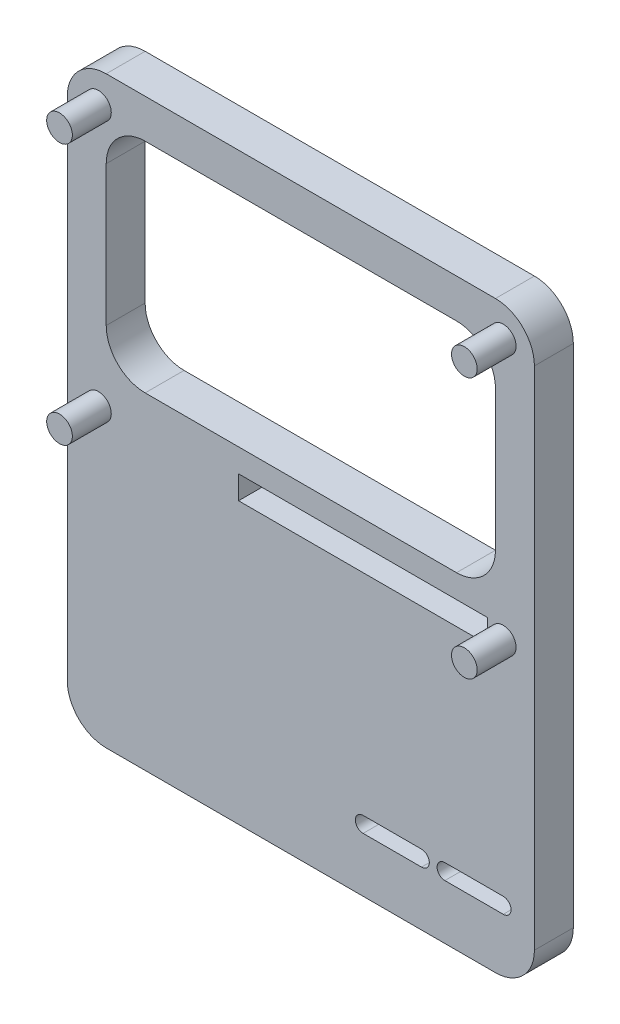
ISO-10303-21;
HEADER;
FILE_DESCRIPTION(('STEP AP214'),'2;1');
FILE_NAME('part.step','',(''),(''),'','','');
FILE_SCHEMA(('AUTOMOTIVE_DESIGN { 1 0 10303 214 1 1 1 1 }'));
ENDSEC;
DATA;
#1=APPLICATION_CONTEXT('core data for automotive mechanical design processes');
#2=APPLICATION_PROTOCOL_DEFINITION('international standard','automotive_design',2000,#1);
#3=PRODUCT_CONTEXT('',#1,'mechanical');
#4=PRODUCT('Part','Part','',(#3));
#5=PRODUCT_RELATED_PRODUCT_CATEGORY('part','',(#4));
#6=PRODUCT_DEFINITION_FORMATION('','',#4);
#7=PRODUCT_DEFINITION_CONTEXT('part definition',#1,'design');
#8=PRODUCT_DEFINITION('design','',#6,#7);
#9=PRODUCT_DEFINITION_SHAPE('','',#8);
#10=(LENGTH_UNIT() NAMED_UNIT(*) SI_UNIT(.MILLI.,.METRE.));
#11=(NAMED_UNIT(*) PLANE_ANGLE_UNIT() SI_UNIT($,.RADIAN.));
#12=(NAMED_UNIT(*) SI_UNIT($,.STERADIAN.) SOLID_ANGLE_UNIT());
#13=UNCERTAINTY_MEASURE_WITH_UNIT(LENGTH_MEASURE(1.E-05),#10,'distance_accuracy_value','');
#14=(GEOMETRIC_REPRESENTATION_CONTEXT(3) GLOBAL_UNCERTAINTY_ASSIGNED_CONTEXT((#13)) GLOBAL_UNIT_ASSIGNED_CONTEXT((#10,
#11,#12)) REPRESENTATION_CONTEXT('',''));
#15=CARTESIAN_POINT('',(0.,0.,0.));
#16=DIRECTION('',(0.,0.,1.));
#17=DIRECTION('',(1.,0.,0.));
#18=AXIS2_PLACEMENT_3D('',#15,#16,#17);
#19=CARTESIAN_POINT('',(18.1515062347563,21.5940291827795,4.30252686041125));
#20=DIRECTION('',(0.,0.,1.));
#21=DIRECTION('',(1.,0.,0.));
#22=AXIS2_PLACEMENT_3D('',#19,#20,#21);
#23=PLANE('',#22);
#24=CARTESIAN_POINT('',(18.8848395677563,22.3273625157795,4.30252686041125));
#25=DIRECTION('',(0.,0.,1.));
#26=DIRECTION('',(-1.,0.,0.));
#27=AXIS2_PLACEMENT_3D('',#24,#25,#26);
#28=CIRCLE('',#27,1.20999999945);
#29=CARTESIAN_POINT('',(17.6748395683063,22.3273625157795,4.30252686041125));
#30=VERTEX_POINT('',#29);
#31=EDGE_CURVE('E783',#30,#30,#28,.T.);
#32=ORIENTED_EDGE('',*,*,#31,.F.);
#33=EDGE_LOOP('',(#32));
#34=FACE_BOUND('',#33,.T.);
#35=CARTESIAN_POINT('',(-19.2484937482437,22.3273625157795,4.30252686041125));
#36=DIRECTION('',(0.,0.,1.));
#37=DIRECTION('',(1.,0.,0.));
#38=AXIS2_PLACEMENT_3D('',#35,#36,#37);
#39=CIRCLE('',#38,1.20999999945);
#40=CARTESIAN_POINT('',(-18.0384937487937,22.3273625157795,4.30252686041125));
#41=VERTEX_POINT('',#40);
#42=EDGE_CURVE('E794',#41,#41,#39,.T.);
#43=ORIENTED_EDGE('',*,*,#42,.F.);
#44=EDGE_LOOP('',(#43));
#45=FACE_BOUND('',#44,.T.);
#46=CARTESIAN_POINT('',(18.8848395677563,-2.23930413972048,4.30252686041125));
#47=DIRECTION('',(0.,0.,1.));
#48=DIRECTION('',(-1.,0.,0.));
#49=AXIS2_PLACEMENT_3D('',#46,#47,#48);
#50=CIRCLE('',#49,1.20999999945);
#51=CARTESIAN_POINT('',(17.6748395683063,-2.23930413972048,4.30252686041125));
#52=VERTEX_POINT('',#51);
#53=EDGE_CURVE('E800',#52,#52,#50,.T.);
#54=ORIENTED_EDGE('',*,*,#53,.F.);
#55=EDGE_LOOP('',(#54));
#56=FACE_BOUND('',#55,.T.);
#57=CARTESIAN_POINT('',(-19.2484937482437,-2.23930413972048,4.30252686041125));
#58=DIRECTION('',(0.,0.,1.));
#59=DIRECTION('',(1.,0.,0.));
#60=AXIS2_PLACEMENT_3D('',#57,#58,#59);
#61=CIRCLE('',#60,1.20999999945);
#62=CARTESIAN_POINT('',(-18.0384937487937,-2.23930413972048,4.30252686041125));
#63=VERTEX_POINT('',#62);
#64=EDGE_CURVE('E806',#63,#63,#61,.T.);
#65=ORIENTED_EDGE('',*,*,#64,.F.);
#66=EDGE_LOOP('',(#65));
#67=FACE_BOUND('',#66,.T.);
#68=DIRECTION('',(-1.,0.,0.));
#69=VECTOR('',#68,1.);
#70=CARTESIAN_POINT('',(-14.8484937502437,21.5940291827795,4.30252686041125));
#71=LINE('',#70,#69);
#72=CARTESIAN_POINT('',(14.4848395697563,21.5940291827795,4.30252686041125));
#73=VERTEX_POINT('',#72);
#74=CARTESIAN_POINT('',(-14.8484937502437,21.5940291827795,4.30252686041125));
#75=VERTEX_POINT('',#74);
#76=EDGE_CURVE('E414',#73,#75,#71,.T.);
#77=ORIENTED_EDGE('',*,*,#76,.F.);
#78=CARTESIAN_POINT('',(14.4848395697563,17.9273625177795,4.30252686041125));
#79=DIRECTION('',(0.,0.,1.));
#80=DIRECTION('',(1.,0.,0.));
#81=AXIS2_PLACEMENT_3D('',#78,#79,#80);
#82=CIRCLE('',#81,3.666666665);
#83=CARTESIAN_POINT('',(18.1515062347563,17.9273625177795,4.30252686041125));
#84=VERTEX_POINT('',#83);
#85=EDGE_CURVE('E412',#84,#73,#82,.T.);
#86=ORIENTED_EDGE('',*,*,#85,.F.);
#87=DIRECTION('',(0.,1.,0.));
#88=VECTOR('',#87,1.);
#89=CARTESIAN_POINT('',(18.1515062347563,17.9273625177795,4.30252686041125));
#90=LINE('',#89,#88);
#91=CARTESIAN_POINT('',(18.1515062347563,4.72736252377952,4.30252686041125));
#92=VERTEX_POINT('',#91);
#93=EDGE_CURVE('E428',#92,#84,#90,.T.);
#94=ORIENTED_EDGE('',*,*,#93,.F.);
#95=CARTESIAN_POINT('',(14.4848395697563,4.72736252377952,4.30252686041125));
#96=DIRECTION('',(0.,0.,1.));
#97=DIRECTION('',(1.,0.,0.));
#98=AXIS2_PLACEMENT_3D('',#95,#96,#97);
#99=CIRCLE('',#98,3.666666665);
#100=CARTESIAN_POINT('',(14.4848395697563,1.06069585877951,4.30252686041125));
#101=VERTEX_POINT('',#100);
#102=EDGE_CURVE('E425',#101,#92,#99,.T.);
#103=ORIENTED_EDGE('',*,*,#102,.F.);
#104=DIRECTION('',(1.,0.,0.));
#105=VECTOR('',#104,1.);
#106=CARTESIAN_POINT('',(-14.8484937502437,1.06069585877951,4.30252686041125));
#107=LINE('',#106,#105);
#108=CARTESIAN_POINT('',(-14.8484937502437,1.06069585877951,4.30252686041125));
#109=VERTEX_POINT('',#108);
#110=EDGE_CURVE('E423',#109,#101,#107,.T.);
#111=ORIENTED_EDGE('',*,*,#110,.F.);
#112=CARTESIAN_POINT('',(-14.8484937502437,4.72736252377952,4.30252686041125));
#113=DIRECTION('',(0.,0.,1.));
#114=DIRECTION('',(1.,0.,0.));
#115=AXIS2_PLACEMENT_3D('',#112,#113,#114);
#116=CIRCLE('',#115,3.666666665);
#117=CARTESIAN_POINT('',(-18.5151604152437,4.72736252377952,4.30252686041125));
#118=VERTEX_POINT('',#117);
#119=EDGE_CURVE('E421',#118,#109,#116,.T.);
#120=ORIENTED_EDGE('',*,*,#119,.F.);
#121=DIRECTION('',(0.,-1.,0.));
#122=VECTOR('',#121,1.);
#123=CARTESIAN_POINT('',(-18.5151604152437,17.9273625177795,4.30252686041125));
#124=LINE('',#123,#122);
#125=CARTESIAN_POINT('',(-18.5151604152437,17.9273625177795,4.30252686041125));
#126=VERTEX_POINT('',#125);
#127=EDGE_CURVE('E419',#126,#118,#124,.T.);
#128=ORIENTED_EDGE('',*,*,#127,.F.);
#129=CARTESIAN_POINT('',(-14.8484937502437,17.9273625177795,4.30252686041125));
#130=DIRECTION('',(0.,0.,1.));
#131=DIRECTION('',(1.,0.,0.));
#132=AXIS2_PLACEMENT_3D('',#129,#130,#131);
#133=CIRCLE('',#132,3.666666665);
#134=EDGE_CURVE('E417',#75,#126,#133,.T.);
#135=ORIENTED_EDGE('',*,*,#134,.F.);
#136=EDGE_LOOP('',(#77,#86,#94,#103,#111,#120,#128,#135));
#137=FACE_BOUND('',#136,.T.);
#138=CARTESIAN_POINT('',(18.1515062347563,21.5940291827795,4.30252686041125));
#139=DIRECTION('',(0.,0.,1.));
#140=DIRECTION('',(1.,0.,0.));
#141=AXIS2_PLACEMENT_3D('',#138,#139,#140);
#142=CIRCLE('',#141,3.666666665);
#143=CARTESIAN_POINT('',(21.8181728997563,21.5940291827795,4.30252686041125));
#144=VERTEX_POINT('',#143);
#145=CARTESIAN_POINT('',(18.1515062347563,25.2606958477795,4.30252686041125));
#146=VERTEX_POINT('',#145);
#147=EDGE_CURVE('E471',#144,#146,#142,.T.);
#148=ORIENTED_EDGE('',*,*,#147,.T.);
#149=DIRECTION('',(-1.,0.,0.));
#150=VECTOR('',#149,1.);
#151=CARTESIAN_POINT('',(-18.5151604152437,25.2606958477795,4.30252686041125));
#152=LINE('',#151,#150);
#153=CARTESIAN_POINT('',(-18.5151604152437,25.2606958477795,4.30252686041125));
#154=VERTEX_POINT('',#153);
#155=EDGE_CURVE('E474',#146,#154,#152,.T.);
#156=ORIENTED_EDGE('',*,*,#155,.T.);
#157=CARTESIAN_POINT('',(-18.5151604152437,21.5940291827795,4.30252686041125));
#158=DIRECTION('',(0.,0.,1.));
#159=DIRECTION('',(1.,0.,0.));
#160=AXIS2_PLACEMENT_3D('',#157,#158,#159);
#161=CIRCLE('',#160,3.666666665);
#162=CARTESIAN_POINT('',(-22.1818270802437,21.5940291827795,4.30252686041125));
#163=VERTEX_POINT('',#162);
#164=EDGE_CURVE('E477',#154,#163,#161,.T.);
#165=ORIENTED_EDGE('',*,*,#164,.T.);
#166=DIRECTION('',(0.,-1.,0.));
#167=VECTOR('',#166,1.);
#168=CARTESIAN_POINT('',(-22.1818270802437,21.5940291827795,4.30252686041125));
#169=LINE('',#168,#167);
#170=CARTESIAN_POINT('',(-22.1818270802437,-26.0726374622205,4.30252686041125));
#171=VERTEX_POINT('',#170);
#172=EDGE_CURVE('E479',#163,#171,#169,.T.);
#173=ORIENTED_EDGE('',*,*,#172,.T.);
#174=CARTESIAN_POINT('',(-18.5151604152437,-26.0726374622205,4.30252686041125));
#175=DIRECTION('',(0.,0.,1.));
#176=DIRECTION('',(1.,0.,0.));
#177=AXIS2_PLACEMENT_3D('',#174,#175,#176);
#178=CIRCLE('',#177,3.666666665);
#179=CARTESIAN_POINT('',(-18.5151604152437,-29.7393041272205,4.30252686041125));
#180=VERTEX_POINT('',#179);
#181=EDGE_CURVE('E481',#171,#180,#178,.T.);
#182=ORIENTED_EDGE('',*,*,#181,.T.);
#183=DIRECTION('',(1.,0.,0.));
#184=VECTOR('',#183,1.);
#185=CARTESIAN_POINT('',(-18.5151604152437,-29.7393041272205,4.30252686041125));
#186=LINE('',#185,#184);
#187=CARTESIAN_POINT('',(18.1515062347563,-29.7393041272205,4.30252686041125));
#188=VERTEX_POINT('',#187);
#189=EDGE_CURVE('E483',#180,#188,#186,.T.);
#190=ORIENTED_EDGE('',*,*,#189,.T.);
#191=CARTESIAN_POINT('',(18.1515062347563,-26.0726374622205,4.30252686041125));
#192=DIRECTION('',(0.,0.,1.));
#193=DIRECTION('',(1.,0.,0.));
#194=AXIS2_PLACEMENT_3D('',#191,#192,#193);
#195=CIRCLE('',#194,3.666666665);
#196=CARTESIAN_POINT('',(21.8181728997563,-26.0726374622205,4.30252686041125));
#197=VERTEX_POINT('',#196);
#198=EDGE_CURVE('E485',#188,#197,#195,.T.);
#199=ORIENTED_EDGE('',*,*,#198,.T.);
#200=DIRECTION('',(0.,1.,0.));
#201=VECTOR('',#200,1.);
#202=CARTESIAN_POINT('',(21.8181728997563,21.5940291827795,4.30252686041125));
#203=LINE('',#202,#201);
#204=EDGE_CURVE('E487',#197,#144,#203,.T.);
#205=ORIENTED_EDGE('',*,*,#204,.T.);
#206=EDGE_LOOP('',(#148,#156,#165,#173,#182,#190,#199,#205));
#207=FACE_BOUND('',#206,.T.);
#208=DIRECTION('',(-1.,0.,0.));
#209=VECTOR('',#208,1.);
#210=CARTESIAN_POINT('',(-6.04849375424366,-1.13930414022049,4.30252686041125));
#211=LINE('',#210,#209);
#212=CARTESIAN_POINT('',(17.4181729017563,-1.13930414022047,4.30252686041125));
#213=VERTEX_POINT('',#212);
#214=CARTESIAN_POINT('',(-6.04849375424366,-1.13930414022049,4.30252686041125));
#215=VERTEX_POINT('',#214);
#216=EDGE_CURVE('E879',#213,#215,#211,.T.);
#217=ORIENTED_EDGE('',*,*,#216,.F.);
#218=DIRECTION('',(0.,1.,0.));
#219=VECTOR('',#218,1.);
#220=CARTESIAN_POINT('',(17.4181729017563,-1.13930414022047,4.30252686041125));
#221=LINE('',#220,#219);
#222=CARTESIAN_POINT('',(17.4181729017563,-3.33930413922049,4.30252686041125));
#223=VERTEX_POINT('',#222);
#224=EDGE_CURVE('E877',#223,#213,#221,.T.);
#225=ORIENTED_EDGE('',*,*,#224,.F.);
#226=DIRECTION('',(1.,0.,0.));
#227=VECTOR('',#226,1.);
#228=CARTESIAN_POINT('',(-6.04849375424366,-3.33930413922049,4.30252686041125));
#229=LINE('',#228,#227);
#230=CARTESIAN_POINT('',(-6.04849375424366,-3.33930413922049,4.30252686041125));
#231=VERTEX_POINT('',#230);
#232=EDGE_CURVE('E885',#231,#223,#229,.T.);
#233=ORIENTED_EDGE('',*,*,#232,.F.);
#234=DIRECTION('',(0.,-1.,0.));
#235=VECTOR('',#234,1.);
#236=CARTESIAN_POINT('',(-6.04849375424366,-1.13930414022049,4.30252686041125));
#237=LINE('',#236,#235);
#238=EDGE_CURVE('E882',#215,#231,#237,.T.);
#239=ORIENTED_EDGE('',*,*,#238,.F.);
#240=EDGE_LOOP('',(#217,#225,#233,#239));
#241=FACE_BOUND('',#240,.T.);
#242=DIRECTION('',(-1.,0.,0.));
#243=VECTOR('',#242,1.);
#244=CARTESIAN_POINT('',(18.8848395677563,-23.1393041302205,4.30252686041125));
#245=LINE('',#244,#243);
#246=CARTESIAN_POINT('',(18.8848395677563,-23.1393041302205,4.30252686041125));
#247=VERTEX_POINT('',#246);
#248=CARTESIAN_POINT('',(13.3848395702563,-23.1393041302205,4.30252686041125));
#249=VERTEX_POINT('',#248);
#250=EDGE_CURVE('E848',#247,#249,#245,.T.);
#251=ORIENTED_EDGE('',*,*,#250,.F.);
#252=CARTESIAN_POINT('',(18.8848395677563,-23.8726374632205,4.30252686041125));
#253=DIRECTION('',(0.,0.,1.));
#254=DIRECTION('',(1.,0.,0.));
#255=AXIS2_PLACEMENT_3D('',#252,#253,#254);
#256=CIRCLE('',#255,0.733333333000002);
#257=CARTESIAN_POINT('',(18.8848395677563,-24.6059707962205,4.30252686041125));
#258=VERTEX_POINT('',#257);
#259=EDGE_CURVE('E846',#258,#247,#256,.T.);
#260=ORIENTED_EDGE('',*,*,#259,.F.);
#261=DIRECTION('',(1.,0.,0.));
#262=VECTOR('',#261,1.);
#263=CARTESIAN_POINT('',(18.8848395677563,-24.6059707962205,4.30252686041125));
#264=LINE('',#263,#262);
#265=CARTESIAN_POINT('',(13.3848395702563,-24.6059707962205,4.30252686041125));
#266=VERTEX_POINT('',#265);
#267=EDGE_CURVE('E854',#266,#258,#264,.T.);
#268=ORIENTED_EDGE('',*,*,#267,.F.);
#269=CARTESIAN_POINT('',(13.3848395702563,-23.8726374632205,4.30252686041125));
#270=DIRECTION('',(0.,0.,1.));
#271=DIRECTION('',(1.,0.,0.));
#272=AXIS2_PLACEMENT_3D('',#269,#270,#271);
#273=CIRCLE('',#272,0.733333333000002);
#274=EDGE_CURVE('E851',#249,#266,#273,.T.);
#275=ORIENTED_EDGE('',*,*,#274,.F.);
#276=EDGE_LOOP('',(#251,#260,#268,#275));
#277=FACE_BOUND('',#276,.T.);
#278=DIRECTION('',(-1.,0.,0.));
#279=VECTOR('',#278,1.);
#280=CARTESIAN_POINT('',(11.1848395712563,-23.1393041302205,4.30252686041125));
#281=LINE('',#280,#279);
#282=CARTESIAN_POINT('',(11.1848395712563,-23.1393041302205,4.30252686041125));
#283=VERTEX_POINT('',#282);
#284=CARTESIAN_POINT('',(5.68483957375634,-23.1393041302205,4.30252686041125));
#285=VERTEX_POINT('',#284);
#286=EDGE_CURVE('E817',#283,#285,#281,.T.);
#287=ORIENTED_EDGE('',*,*,#286,.F.);
#288=CARTESIAN_POINT('',(11.1848395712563,-23.8726374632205,4.30252686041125));
#289=DIRECTION('',(0.,0.,1.));
#290=DIRECTION('',(1.,0.,0.));
#291=AXIS2_PLACEMENT_3D('',#288,#289,#290);
#292=CIRCLE('',#291,0.733333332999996);
#293=CARTESIAN_POINT('',(11.1848395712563,-24.6059707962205,4.30252686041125));
#294=VERTEX_POINT('',#293);
#295=EDGE_CURVE('E815',#294,#283,#292,.T.);
#296=ORIENTED_EDGE('',*,*,#295,.F.);
#297=DIRECTION('',(1.,0.,0.));
#298=VECTOR('',#297,1.);
#299=CARTESIAN_POINT('',(11.1848395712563,-24.6059707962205,4.30252686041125));
#300=LINE('',#299,#298);
#301=CARTESIAN_POINT('',(5.68483957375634,-24.6059707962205,4.30252686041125));
#302=VERTEX_POINT('',#301);
#303=EDGE_CURVE('E823',#302,#294,#300,.T.);
#304=ORIENTED_EDGE('',*,*,#303,.F.);
#305=CARTESIAN_POINT('',(5.68483957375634,-23.8726374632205,4.30252686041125));
#306=DIRECTION('',(0.,0.,1.));
#307=DIRECTION('',(1.,0.,0.));
#308=AXIS2_PLACEMENT_3D('',#305,#306,#307);
#309=CIRCLE('',#308,0.733333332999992);
#310=EDGE_CURVE('E820',#285,#302,#309,.T.);
#311=ORIENTED_EDGE('',*,*,#310,.F.);
#312=EDGE_LOOP('',(#287,#296,#304,#311));
#313=FACE_BOUND('',#312,.T.);
#314=ADVANCED_FACE('F45',(#34,#45,#56,#67,#137,#207,#241,#277,#313),#23,.T.);
#315=CARTESIAN_POINT('',(18.1515062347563,21.5940291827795,0.635860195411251));
#316=DIRECTION('',(0.,0.,1.));
#317=DIRECTION('',(1.,0.,0.));
#318=AXIS2_PLACEMENT_3D('',#315,#316,#317);
#319=PLANE('',#318);
#320=CARTESIAN_POINT('',(18.8848395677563,-23.8726374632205,0.635860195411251));
#321=DIRECTION('',(0.,0.,1.));
#322=DIRECTION('',(1.,0.,0.));
#323=AXIS2_PLACEMENT_3D('',#320,#321,#322);
#324=CIRCLE('',#323,0.733333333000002);
#325=CARTESIAN_POINT('',(18.8848395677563,-24.6059707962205,0.635860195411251));
#326=VERTEX_POINT('',#325);
#327=CARTESIAN_POINT('',(18.8848395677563,-23.1393041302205,0.635860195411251));
#328=VERTEX_POINT('',#327);
#329=EDGE_CURVE('E845',#326,#328,#324,.T.);
#330=ORIENTED_EDGE('',*,*,#329,.T.);
#331=DIRECTION('',(-1.,0.,0.));
#332=VECTOR('',#331,1.);
#333=CARTESIAN_POINT('',(18.8848395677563,-23.1393041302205,0.635860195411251));
#334=LINE('',#333,#332);
#335=CARTESIAN_POINT('',(13.3848395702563,-23.1393041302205,0.635860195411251));
#336=VERTEX_POINT('',#335);
#337=EDGE_CURVE('E859',#328,#336,#334,.T.);
#338=ORIENTED_EDGE('',*,*,#337,.T.);
#339=CARTESIAN_POINT('',(13.3848395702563,-23.8726374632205,0.635860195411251));
#340=DIRECTION('',(0.,0.,1.));
#341=DIRECTION('',(1.,0.,0.));
#342=AXIS2_PLACEMENT_3D('',#339,#340,#341);
#343=CIRCLE('',#342,0.733333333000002);
#344=CARTESIAN_POINT('',(13.3848395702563,-24.6059707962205,0.635860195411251));
#345=VERTEX_POINT('',#344);
#346=EDGE_CURVE('E862',#336,#345,#343,.T.);
#347=ORIENTED_EDGE('',*,*,#346,.T.);
#348=DIRECTION('',(1.,0.,0.));
#349=VECTOR('',#348,1.);
#350=CARTESIAN_POINT('',(18.8848395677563,-24.6059707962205,0.635860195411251));
#351=LINE('',#350,#349);
#352=EDGE_CURVE('E849',#345,#326,#351,.T.);
#353=ORIENTED_EDGE('',*,*,#352,.T.);
#354=EDGE_LOOP('',(#330,#338,#347,#353));
#355=FACE_BOUND('',#354,.T.);
#356=DIRECTION('',(0.,1.,0.));
#357=VECTOR('',#356,1.);
#358=CARTESIAN_POINT('',(17.4181729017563,-9.20597080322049,0.635860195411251));
#359=LINE('',#358,#357);
#360=CARTESIAN_POINT('',(17.4181729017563,-12.1393041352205,0.635860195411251));
#361=VERTEX_POINT('',#360);
#362=CARTESIAN_POINT('',(17.4181729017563,-9.20597080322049,0.635860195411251));
#363=VERTEX_POINT('',#362);
#364=EDGE_CURVE('E383',#361,#363,#359,.T.);
#365=ORIENTED_EDGE('',*,*,#364,.T.);
#366=DIRECTION('',(-1.,0.,0.));
#367=VECTOR('',#366,1.);
#368=CARTESIAN_POINT('',(17.4181729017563,-9.20597080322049,0.635860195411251));
#369=LINE('',#368,#367);
#370=CARTESIAN_POINT('',(14.4848395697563,-9.20597080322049,0.635860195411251));
#371=VERTEX_POINT('',#370);
#372=EDGE_CURVE('E389',#363,#371,#369,.T.);
#373=ORIENTED_EDGE('',*,*,#372,.T.);
#374=DIRECTION('',(0.,1.,0.));
#375=VECTOR('',#374,1.);
#376=CARTESIAN_POINT('',(14.4848395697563,-6.27263747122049,0.635860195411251));
#377=LINE('',#376,#375);
#378=CARTESIAN_POINT('',(14.4848395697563,-6.27263747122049,0.635860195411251));
#379=VERTEX_POINT('',#378);
#380=EDGE_CURVE('E907',#371,#379,#377,.T.);
#381=ORIENTED_EDGE('',*,*,#380,.T.);
#382=DIRECTION('',(-1.,0.,0.));
#383=VECTOR('',#382,1.);
#384=CARTESIAN_POINT('',(14.4848395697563,-6.27263747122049,0.635860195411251));
#385=LINE('',#384,#383);
#386=CARTESIAN_POINT('',(11.5515062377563,-6.27263747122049,0.635860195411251));
#387=VERTEX_POINT('',#386);
#388=EDGE_CURVE('E910',#379,#387,#385,.T.);
#389=ORIENTED_EDGE('',*,*,#388,.T.);
#390=DIRECTION('',(0.,-1.,0.));
#391=VECTOR('',#390,1.);
#392=CARTESIAN_POINT('',(11.5515062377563,-6.27263747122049,0.635860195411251));
#393=LINE('',#392,#391);
#394=CARTESIAN_POINT('',(11.5515062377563,-9.20597080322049,0.635860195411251));
#395=VERTEX_POINT('',#394);
#396=EDGE_CURVE('E913',#387,#395,#393,.T.);
#397=ORIENTED_EDGE('',*,*,#396,.T.);
#398=DIRECTION('',(-1.,0.,0.));
#399=VECTOR('',#398,1.);
#400=CARTESIAN_POINT('',(11.5515062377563,-9.20597080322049,0.635860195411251));
#401=LINE('',#400,#399);
#402=CARTESIAN_POINT('',(8.61817290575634,-9.20597080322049,0.635860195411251));
#403=VERTEX_POINT('',#402);
#404=EDGE_CURVE('E916',#395,#403,#401,.T.);
#405=ORIENTED_EDGE('',*,*,#404,.T.);
#406=DIRECTION('',(0.,-1.,0.));
#407=VECTOR('',#406,1.);
#408=CARTESIAN_POINT('',(8.61817290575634,-9.20597080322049,0.635860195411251));
#409=LINE('',#408,#407);
#410=CARTESIAN_POINT('',(8.61817290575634,-12.1393041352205,0.635860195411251));
#411=VERTEX_POINT('',#410);
#412=EDGE_CURVE('E919',#403,#411,#409,.T.);
#413=ORIENTED_EDGE('',*,*,#412,.T.);
#414=DIRECTION('',(1.,0.,0.));
#415=VECTOR('',#414,1.);
#416=CARTESIAN_POINT('',(11.5515062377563,-12.1393041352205,0.635860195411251));
#417=LINE('',#416,#415);
#418=CARTESIAN_POINT('',(11.5515062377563,-12.1393041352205,0.635860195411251));
#419=VERTEX_POINT('',#418);
#420=EDGE_CURVE('E922',#411,#419,#417,.T.);
#421=ORIENTED_EDGE('',*,*,#420,.T.);
#422=DIRECTION('',(0.,-1.,0.));
#423=VECTOR('',#422,1.);
#424=CARTESIAN_POINT('',(11.5515062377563,-12.1393041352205,0.635860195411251));
#425=LINE('',#424,#423);
#426=CARTESIAN_POINT('',(11.5515062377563,-15.0726374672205,0.635860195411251));
#427=VERTEX_POINT('',#426);
#428=EDGE_CURVE('E925',#419,#427,#425,.T.);
#429=ORIENTED_EDGE('',*,*,#428,.T.);
#430=DIRECTION('',(1.,0.,0.));
#431=VECTOR('',#430,1.);
#432=CARTESIAN_POINT('',(14.4848395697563,-15.0726374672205,0.635860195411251));
#433=LINE('',#432,#431);
#434=CARTESIAN_POINT('',(14.4848395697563,-15.0726374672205,0.635860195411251));
#435=VERTEX_POINT('',#434);
#436=EDGE_CURVE('E402',#427,#435,#433,.T.);
#437=ORIENTED_EDGE('',*,*,#436,.T.);
#438=DIRECTION('',(0.,1.,0.));
#439=VECTOR('',#438,1.);
#440=CARTESIAN_POINT('',(14.4848395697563,-12.1393041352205,0.635860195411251));
#441=LINE('',#440,#439);
#442=CARTESIAN_POINT('',(14.4848395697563,-12.1393041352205,0.635860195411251));
#443=VERTEX_POINT('',#442);
#444=EDGE_CURVE('E396',#435,#443,#441,.T.);
#445=ORIENTED_EDGE('',*,*,#444,.T.);
#446=DIRECTION('',(1.,0.,0.));
#447=VECTOR('',#446,1.);
#448=CARTESIAN_POINT('',(17.4181729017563,-12.1393041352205,0.635860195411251));
#449=LINE('',#448,#447);
#450=EDGE_CURVE('E372',#443,#361,#449,.T.);
#451=ORIENTED_EDGE('',*,*,#450,.T.);
#452=EDGE_LOOP('',(#365,#373,#381,#389,#397,#405,#413,#421,#429,#437,#445,#451));
#453=FACE_BOUND('',#452,.T.);
#454=CARTESIAN_POINT('',(-16.3151604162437,-15.0726374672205,0.635860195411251));
#455=DIRECTION('',(0.,0.,1.));
#456=DIRECTION('',(1.,0.,0.));
#457=AXIS2_PLACEMENT_3D('',#454,#455,#456);
#458=CIRCLE('',#457,2.5666666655);
#459=CARTESIAN_POINT('',(-13.7484937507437,-15.0726374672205,0.635860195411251));
#460=VERTEX_POINT('',#459);
#461=EDGE_CURVE('E779',#460,#460,#458,.T.);
#462=ORIENTED_EDGE('',*,*,#461,.T.);
#463=EDGE_LOOP('',(#462));
#464=FACE_BOUND('',#463,.T.);
#465=CARTESIAN_POINT('',(-8.98182708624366,-21.6726374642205,0.635860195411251));
#466=DIRECTION('',(0.,0.,1.));
#467=DIRECTION('',(1.,0.,0.));
#468=AXIS2_PLACEMENT_3D('',#465,#466,#467);
#469=CIRCLE('',#468,4.399999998);
#470=CARTESIAN_POINT('',(-4.58182708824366,-21.6726374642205,0.635860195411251));
#471=VERTEX_POINT('',#470);
#472=EDGE_CURVE('E777',#471,#471,#469,.T.);
#473=ORIENTED_EDGE('',*,*,#472,.T.);
#474=EDGE_LOOP('',(#473));
#475=FACE_BOUND('',#474,.T.);
#476=CARTESIAN_POINT('',(14.4848395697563,17.9273625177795,0.635860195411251));
#477=DIRECTION('',(0.,0.,1.));
#478=DIRECTION('',(1.,0.,0.));
#479=AXIS2_PLACEMENT_3D('',#476,#477,#478);
#480=CIRCLE('',#479,3.666666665);
#481=CARTESIAN_POINT('',(18.1515062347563,17.9273625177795,0.635860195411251));
#482=VERTEX_POINT('',#481);
#483=CARTESIAN_POINT('',(14.4848395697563,21.5940291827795,0.635860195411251));
#484=VERTEX_POINT('',#483);
#485=EDGE_CURVE('E411',#482,#484,#480,.T.);
#486=ORIENTED_EDGE('',*,*,#485,.T.);
#487=DIRECTION('',(-1.,0.,0.));
#488=VECTOR('',#487,1.);
#489=CARTESIAN_POINT('',(-14.8484937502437,21.5940291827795,0.635860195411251));
#490=LINE('',#489,#488);
#491=CARTESIAN_POINT('',(-14.8484937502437,21.5940291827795,0.635860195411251));
#492=VERTEX_POINT('',#491);
#493=EDGE_CURVE('E433',#484,#492,#490,.T.);
#494=ORIENTED_EDGE('',*,*,#493,.T.);
#495=CARTESIAN_POINT('',(-14.8484937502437,17.9273625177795,0.635860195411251));
#496=DIRECTION('',(0.,0.,1.));
#497=DIRECTION('',(1.,0.,0.));
#498=AXIS2_PLACEMENT_3D('',#495,#496,#497);
#499=CIRCLE('',#498,3.666666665);
#500=CARTESIAN_POINT('',(-18.5151604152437,17.9273625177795,0.635860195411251));
#501=VERTEX_POINT('',#500);
#502=EDGE_CURVE('E436',#492,#501,#499,.T.);
#503=ORIENTED_EDGE('',*,*,#502,.T.);
#504=DIRECTION('',(0.,-1.,0.));
#505=VECTOR('',#504,1.);
#506=CARTESIAN_POINT('',(-18.5151604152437,17.9273625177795,0.635860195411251));
#507=LINE('',#506,#505);
#508=CARTESIAN_POINT('',(-18.5151604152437,4.72736252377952,0.635860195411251));
#509=VERTEX_POINT('',#508);
#510=EDGE_CURVE('E439',#501,#509,#507,.T.);
#511=ORIENTED_EDGE('',*,*,#510,.T.);
#512=CARTESIAN_POINT('',(-14.8484937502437,4.72736252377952,0.635860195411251));
#513=DIRECTION('',(0.,0.,1.));
#514=DIRECTION('',(1.,0.,0.));
#515=AXIS2_PLACEMENT_3D('',#512,#513,#514);
#516=CIRCLE('',#515,3.666666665);
#517=CARTESIAN_POINT('',(-14.8484937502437,1.06069585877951,0.635860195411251));
#518=VERTEX_POINT('',#517);
#519=EDGE_CURVE('E442',#509,#518,#516,.T.);
#520=ORIENTED_EDGE('',*,*,#519,.T.);
#521=DIRECTION('',(1.,0.,0.));
#522=VECTOR('',#521,1.);
#523=CARTESIAN_POINT('',(-14.8484937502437,1.06069585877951,0.635860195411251));
#524=LINE('',#523,#522);
#525=CARTESIAN_POINT('',(14.4848395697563,1.06069585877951,0.635860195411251));
#526=VERTEX_POINT('',#525);
#527=EDGE_CURVE('E445',#518,#526,#524,.T.);
#528=ORIENTED_EDGE('',*,*,#527,.T.);
#529=CARTESIAN_POINT('',(14.4848395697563,4.72736252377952,0.635860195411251));
#530=DIRECTION('',(0.,0.,1.));
#531=DIRECTION('',(1.,0.,0.));
#532=AXIS2_PLACEMENT_3D('',#529,#530,#531);
#533=CIRCLE('',#532,3.666666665);
#534=CARTESIAN_POINT('',(18.1515062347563,4.72736252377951,0.635860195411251));
#535=VERTEX_POINT('',#534);
#536=EDGE_CURVE('E448',#526,#535,#533,.T.);
#537=ORIENTED_EDGE('',*,*,#536,.T.);
#538=DIRECTION('',(0.,1.,0.));
#539=VECTOR('',#538,1.);
#540=CARTESIAN_POINT('',(18.1515062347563,17.9273625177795,0.635860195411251));
#541=LINE('',#540,#539);
#542=EDGE_CURVE('E415',#535,#482,#541,.T.);
#543=ORIENTED_EDGE('',*,*,#542,.T.);
#544=EDGE_LOOP('',(#486,#494,#503,#511,#520,#528,#537,#543));
#545=FACE_BOUND('',#544,.T.);
#546=CARTESIAN_POINT('',(18.1515062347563,21.5940291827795,0.635860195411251));
#547=DIRECTION('',(0.,0.,1.));
#548=DIRECTION('',(1.,0.,0.));
#549=AXIS2_PLACEMENT_3D('',#546,#547,#548);
#550=CIRCLE('',#549,3.666666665);
#551=CARTESIAN_POINT('',(21.8181728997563,21.5940291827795,0.635860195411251));
#552=VERTEX_POINT('',#551);
#553=CARTESIAN_POINT('',(18.1515062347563,25.2606958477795,0.635860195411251));
#554=VERTEX_POINT('',#553);
#555=EDGE_CURVE('E470',#552,#554,#550,.T.);
#556=ORIENTED_EDGE('',*,*,#555,.F.);
#557=DIRECTION('',(0.,1.,0.));
#558=VECTOR('',#557,1.);
#559=CARTESIAN_POINT('',(21.8181728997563,21.5940291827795,0.635860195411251));
#560=LINE('',#559,#558);
#561=CARTESIAN_POINT('',(21.8181728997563,-26.0726374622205,0.635860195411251));
#562=VERTEX_POINT('',#561);
#563=EDGE_CURVE('E475',#562,#552,#560,.T.);
#564=ORIENTED_EDGE('',*,*,#563,.F.);
#565=CARTESIAN_POINT('',(18.1515062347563,-26.0726374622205,0.635860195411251));
#566=DIRECTION('',(0.,0.,1.));
#567=DIRECTION('',(1.,0.,0.));
#568=AXIS2_PLACEMENT_3D('',#565,#566,#567);
#569=CIRCLE('',#568,3.666666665);
#570=CARTESIAN_POINT('',(18.1515062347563,-29.7393041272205,0.635860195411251));
#571=VERTEX_POINT('',#570);
#572=EDGE_CURVE('E502',#571,#562,#569,.T.);
#573=ORIENTED_EDGE('',*,*,#572,.F.);
#574=DIRECTION('',(1.,0.,0.));
#575=VECTOR('',#574,1.);
#576=CARTESIAN_POINT('',(-18.5151604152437,-29.7393041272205,0.635860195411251));
#577=LINE('',#576,#575);
#578=CARTESIAN_POINT('',(-18.5151604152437,-29.7393041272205,0.635860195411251));
#579=VERTEX_POINT('',#578);
#580=EDGE_CURVE('E500',#579,#571,#577,.T.);
#581=ORIENTED_EDGE('',*,*,#580,.F.);
#582=CARTESIAN_POINT('',(-18.5151604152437,-26.0726374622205,0.635860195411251));
#583=DIRECTION('',(0.,0.,1.));
#584=DIRECTION('',(1.,0.,0.));
#585=AXIS2_PLACEMENT_3D('',#582,#583,#584);
#586=CIRCLE('',#585,3.666666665);
#587=CARTESIAN_POINT('',(-22.1818270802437,-26.0726374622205,0.635860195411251));
#588=VERTEX_POINT('',#587);
#589=EDGE_CURVE('E498',#588,#579,#586,.T.);
#590=ORIENTED_EDGE('',*,*,#589,.F.);
#591=DIRECTION('',(0.,-1.,0.));
#592=VECTOR('',#591,1.);
#593=CARTESIAN_POINT('',(-22.1818270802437,21.5940291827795,0.635860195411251));
#594=LINE('',#593,#592);
#595=CARTESIAN_POINT('',(-22.1818270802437,21.5940291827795,0.635860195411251));
#596=VERTEX_POINT('',#595);
#597=EDGE_CURVE('E496',#596,#588,#594,.T.);
#598=ORIENTED_EDGE('',*,*,#597,.F.);
#599=CARTESIAN_POINT('',(-18.5151604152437,21.5940291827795,0.635860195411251));
#600=DIRECTION('',(0.,0.,1.));
#601=DIRECTION('',(1.,0.,0.));
#602=AXIS2_PLACEMENT_3D('',#599,#600,#601);
#603=CIRCLE('',#602,3.666666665);
#604=CARTESIAN_POINT('',(-18.5151604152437,25.2606958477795,0.635860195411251));
#605=VERTEX_POINT('',#604);
#606=EDGE_CURVE('E494',#605,#596,#603,.T.);
#607=ORIENTED_EDGE('',*,*,#606,.F.);
#608=DIRECTION('',(-1.,0.,0.));
#609=VECTOR('',#608,1.);
#610=CARTESIAN_POINT('',(-18.5151604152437,25.2606958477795,0.635860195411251));
#611=LINE('',#610,#609);
#612=EDGE_CURVE('E492',#554,#605,#611,.T.);
#613=ORIENTED_EDGE('',*,*,#612,.F.);
#614=EDGE_LOOP('',(#556,#564,#573,#581,#590,#598,#607,#613));
#615=FACE_BOUND('',#614,.T.);
#616=DIRECTION('',(-0.499999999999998,-0.86602540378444,0.));
#617=VECTOR('',#616,1.);
#618=CARTESIAN_POINT('',(-7.51516042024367,-8.72178450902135,0.635860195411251));
#619=LINE('',#618,#617);
#620=CARTESIAN_POINT('',(-7.51516042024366,-8.72178450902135,0.635860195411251));
#621=VERTEX_POINT('',#620);
#622=CARTESIAN_POINT('',(-11.1818270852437,-15.0726374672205,0.635860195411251));
#623=VERTEX_POINT('',#622);
#624=EDGE_CURVE('E397',#621,#623,#619,.T.);
#625=ORIENTED_EDGE('',*,*,#624,.T.);
#626=DIRECTION('',(1.,0.,0.));
#627=VECTOR('',#626,1.);
#628=CARTESIAN_POINT('',(-11.1818270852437,-15.0726374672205,0.635860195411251));
#629=LINE('',#628,#627);
#630=CARTESIAN_POINT('',(-3.84849375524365,-15.0726374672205,0.635860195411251));
#631=VERTEX_POINT('',#630);
#632=EDGE_CURVE('E400',#623,#631,#629,.T.);
#633=ORIENTED_EDGE('',*,*,#632,.T.);
#634=DIRECTION('',(-0.500000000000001,0.866025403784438,0.));
#635=VECTOR('',#634,1.);
#636=CARTESIAN_POINT('',(-3.84849375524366,-15.0726374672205,0.635860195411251));
#637=LINE('',#636,#635);
#638=EDGE_CURVE('E408',#631,#621,#637,.T.);
#639=ORIENTED_EDGE('',*,*,#638,.T.);
#640=EDGE_LOOP('',(#625,#633,#639));
#641=FACE_BOUND('',#640,.T.);
#642=CARTESIAN_POINT('',(-13.3818270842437,-2.23930413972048,0.635860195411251));
#643=DIRECTION('',(0.,0.,1.));
#644=DIRECTION('',(1.,0.,0.));
#645=AXIS2_PLACEMENT_3D('',#642,#643,#644);
#646=CIRCLE('',#645,1.8333333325);
#647=CARTESIAN_POINT('',(-11.5484937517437,-2.23930413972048,0.635860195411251));
#648=VERTEX_POINT('',#647);
#649=EDGE_CURVE('E380',#648,#648,#646,.T.);
#650=ORIENTED_EDGE('',*,*,#649,.T.);
#651=EDGE_LOOP('',(#650));
#652=FACE_BOUND('',#651,.T.);
#653=DIRECTION('',(0.,1.,0.));
#654=VECTOR('',#653,1.);
#655=CARTESIAN_POINT('',(17.4181729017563,-1.13930414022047,0.635860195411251));
#656=LINE('',#655,#654);
#657=CARTESIAN_POINT('',(17.4181729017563,-3.33930413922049,0.635860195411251));
#658=VERTEX_POINT('',#657);
#659=CARTESIAN_POINT('',(17.4181729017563,-1.13930414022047,0.635860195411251));
#660=VERTEX_POINT('',#659);
#661=EDGE_CURVE('E876',#658,#660,#656,.T.);
#662=ORIENTED_EDGE('',*,*,#661,.T.);
#663=DIRECTION('',(-1.,0.,0.));
#664=VECTOR('',#663,1.);
#665=CARTESIAN_POINT('',(-6.04849375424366,-1.13930414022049,0.635860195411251));
#666=LINE('',#665,#664);
#667=CARTESIAN_POINT('',(-6.04849375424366,-1.13930414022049,0.635860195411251));
#668=VERTEX_POINT('',#667);
#669=EDGE_CURVE('E890',#660,#668,#666,.T.);
#670=ORIENTED_EDGE('',*,*,#669,.T.);
#671=DIRECTION('',(0.,-1.,0.));
#672=VECTOR('',#671,1.);
#673=CARTESIAN_POINT('',(-6.04849375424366,-1.13930414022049,0.635860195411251));
#674=LINE('',#673,#672);
#675=CARTESIAN_POINT('',(-6.04849375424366,-3.33930413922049,0.635860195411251));
#676=VERTEX_POINT('',#675);
#677=EDGE_CURVE('E893',#668,#676,#674,.T.);
#678=ORIENTED_EDGE('',*,*,#677,.T.);
#679=DIRECTION('',(1.,0.,0.));
#680=VECTOR('',#679,1.);
#681=CARTESIAN_POINT('',(-6.04849375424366,-3.33930413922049,0.635860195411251));
#682=LINE('',#681,#680);
#683=EDGE_CURVE('E880',#676,#658,#682,.T.);
#684=ORIENTED_EDGE('',*,*,#683,.T.);
#685=EDGE_LOOP('',(#662,#670,#678,#684));
#686=FACE_BOUND('',#685,.T.);
#687=CARTESIAN_POINT('',(11.1848395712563,-23.8726374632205,0.635860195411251));
#688=DIRECTION('',(0.,0.,1.));
#689=DIRECTION('',(1.,0.,0.));
#690=AXIS2_PLACEMENT_3D('',#687,#688,#689);
#691=CIRCLE('',#690,0.733333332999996);
#692=CARTESIAN_POINT('',(11.1848395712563,-24.6059707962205,0.635860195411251));
#693=VERTEX_POINT('',#692);
#694=CARTESIAN_POINT('',(11.1848395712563,-23.1393041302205,0.635860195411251));
#695=VERTEX_POINT('',#694);
#696=EDGE_CURVE('E812',#693,#695,#691,.T.);
#697=ORIENTED_EDGE('',*,*,#696,.T.);
#698=DIRECTION('',(-1.,0.,0.));
#699=VECTOR('',#698,1.);
#700=CARTESIAN_POINT('',(11.1848395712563,-23.1393041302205,0.635860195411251));
#701=LINE('',#700,#699);
#702=CARTESIAN_POINT('',(5.68483957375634,-23.1393041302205,0.635860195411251));
#703=VERTEX_POINT('',#702);
#704=EDGE_CURVE('E828',#695,#703,#701,.T.);
#705=ORIENTED_EDGE('',*,*,#704,.T.);
#706=CARTESIAN_POINT('',(5.68483957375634,-23.8726374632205,0.635860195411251));
#707=DIRECTION('',(0.,0.,1.));
#708=DIRECTION('',(1.,0.,0.));
#709=AXIS2_PLACEMENT_3D('',#706,#707,#708);
#710=CIRCLE('',#709,0.733333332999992);
#711=CARTESIAN_POINT('',(5.68483957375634,-24.6059707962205,0.635860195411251));
#712=VERTEX_POINT('',#711);
#713=EDGE_CURVE('E831',#703,#712,#710,.T.);
#714=ORIENTED_EDGE('',*,*,#713,.T.);
#715=DIRECTION('',(1.,0.,0.));
#716=VECTOR('',#715,1.);
#717=CARTESIAN_POINT('',(11.1848395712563,-24.6059707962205,0.635860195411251));
#718=LINE('',#717,#716);
#719=EDGE_CURVE('E818',#712,#693,#718,.T.);
#720=ORIENTED_EDGE('',*,*,#719,.T.);
#721=EDGE_LOOP('',(#697,#705,#714,#720));
#722=FACE_BOUND('',#721,.T.);
#723=ADVANCED_FACE('F392',(#355,#453,#464,#475,#545,#615,#641,#652,#686,#722),#319,.F.);
#724=CARTESIAN_POINT('',(18.1515062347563,21.5940291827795,4.30252686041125));
#725=DIRECTION('',(0.,0.,-1.));
#726=DIRECTION('',(-1.,0.,0.));
#727=AXIS2_PLACEMENT_3D('',#724,#725,#726);
#728=CYLINDRICAL_SURFACE('',#727,3.666666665);
#729=ORIENTED_EDGE('',*,*,#555,.T.);
#730=DIRECTION('',(0.,0.,-1.));
#731=VECTOR('',#730,1.);
#732=CARTESIAN_POINT('',(18.1515062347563,25.2606958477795,4.30252686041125));
#733=LINE('',#732,#731);
#734=EDGE_CURVE('E525',#146,#554,#733,.T.);
#735=ORIENTED_EDGE('',*,*,#734,.F.);
#736=ORIENTED_EDGE('',*,*,#147,.F.);
#737=DIRECTION('',(0.,0.,-1.));
#738=VECTOR('',#737,1.);
#739=CARTESIAN_POINT('',(21.8181728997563,21.5940291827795,4.30252686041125));
#740=LINE('',#739,#738);
#741=EDGE_CURVE('E489',#144,#552,#740,.T.);
#742=ORIENTED_EDGE('',*,*,#741,.T.);
#743=EDGE_LOOP('',(#729,#735,#736,#742));
#744=FACE_BOUND('',#743,.T.);
#745=ADVANCED_FACE('F660',(#744),#728,.T.);
#746=CARTESIAN_POINT('',(-18.5151604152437,25.2606958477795,4.30252686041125));
#747=DIRECTION('',(0.,-1.,0.));
#748=DIRECTION('',(0.,0.,-1.));
#749=AXIS2_PLACEMENT_3D('',#746,#747,#748);
#750=PLANE('',#749);
#751=ORIENTED_EDGE('',*,*,#612,.T.);
#752=DIRECTION('',(0.,0.,-1.));
#753=VECTOR('',#752,1.);
#754=CARTESIAN_POINT('',(-18.5151604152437,25.2606958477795,4.30252686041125));
#755=LINE('',#754,#753);
#756=EDGE_CURVE('E522',#154,#605,#755,.T.);
#757=ORIENTED_EDGE('',*,*,#756,.F.);
#758=ORIENTED_EDGE('',*,*,#155,.F.);
#759=ORIENTED_EDGE('',*,*,#734,.T.);
#760=EDGE_LOOP('',(#751,#757,#758,#759));
#761=FACE_BOUND('',#760,.T.);
#762=ADVANCED_FACE('F692',(#761),#750,.F.);
#763=CARTESIAN_POINT('',(-18.5151604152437,21.5940291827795,4.30252686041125));
#764=DIRECTION('',(0.,0.,-1.));
#765=DIRECTION('',(-1.,0.,0.));
#766=AXIS2_PLACEMENT_3D('',#763,#764,#765);
#767=CYLINDRICAL_SURFACE('',#766,3.666666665);
#768=ORIENTED_EDGE('',*,*,#606,.T.);
#769=DIRECTION('',(0.,0.,-1.));
#770=VECTOR('',#769,1.);
#771=CARTESIAN_POINT('',(-22.1818270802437,21.5940291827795,4.30252686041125));
#772=LINE('',#771,#770);
#773=EDGE_CURVE('E519',#163,#596,#772,.T.);
#774=ORIENTED_EDGE('',*,*,#773,.F.);
#775=ORIENTED_EDGE('',*,*,#164,.F.);
#776=ORIENTED_EDGE('',*,*,#756,.T.);
#777=EDGE_LOOP('',(#768,#774,#775,#776));
#778=FACE_BOUND('',#777,.T.);
#779=ADVANCED_FACE('F688',(#778),#767,.T.);
#780=CARTESIAN_POINT('',(-22.1818270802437,21.5940291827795,4.30252686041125));
#781=DIRECTION('',(1.,0.,0.));
#782=DIRECTION('',(0.,1.,0.));
#783=AXIS2_PLACEMENT_3D('',#780,#781,#782);
#784=PLANE('',#783);
#785=ORIENTED_EDGE('',*,*,#597,.T.);
#786=DIRECTION('',(0.,0.,-1.));
#787=VECTOR('',#786,1.);
#788=CARTESIAN_POINT('',(-22.1818270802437,-26.0726374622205,4.30252686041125));
#789=LINE('',#788,#787);
#790=EDGE_CURVE('E516',#171,#588,#789,.T.);
#791=ORIENTED_EDGE('',*,*,#790,.F.);
#792=ORIENTED_EDGE('',*,*,#172,.F.);
#793=ORIENTED_EDGE('',*,*,#773,.T.);
#794=EDGE_LOOP('',(#785,#791,#792,#793));
#795=FACE_BOUND('',#794,.T.);
#796=ADVANCED_FACE('F684',(#795),#784,.F.);
#797=CARTESIAN_POINT('',(-18.5151604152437,-26.0726374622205,4.30252686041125));
#798=DIRECTION('',(0.,0.,-1.));
#799=DIRECTION('',(-1.,0.,0.));
#800=AXIS2_PLACEMENT_3D('',#797,#798,#799);
#801=CYLINDRICAL_SURFACE('',#800,3.666666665);
#802=ORIENTED_EDGE('',*,*,#589,.T.);
#803=DIRECTION('',(0.,0.,-1.));
#804=VECTOR('',#803,1.);
#805=CARTESIAN_POINT('',(-18.5151604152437,-29.7393041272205,4.30252686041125));
#806=LINE('',#805,#804);
#807=EDGE_CURVE('E513',#180,#579,#806,.T.);
#808=ORIENTED_EDGE('',*,*,#807,.F.);
#809=ORIENTED_EDGE('',*,*,#181,.F.);
#810=ORIENTED_EDGE('',*,*,#790,.T.);
#811=EDGE_LOOP('',(#802,#808,#809,#810));
#812=FACE_BOUND('',#811,.T.);
#813=ADVANCED_FACE('F680',(#812),#801,.T.);
#814=CARTESIAN_POINT('',(-18.5151604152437,-29.7393041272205,4.30252686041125));
#815=DIRECTION('',(0.,1.,0.));
#816=DIRECTION('',(0.,0.,1.));
#817=AXIS2_PLACEMENT_3D('',#814,#815,#816);
#818=PLANE('',#817);
#819=ORIENTED_EDGE('',*,*,#580,.T.);
#820=DIRECTION('',(0.,0.,-1.));
#821=VECTOR('',#820,1.);
#822=CARTESIAN_POINT('',(18.1515062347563,-29.7393041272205,4.30252686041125));
#823=LINE('',#822,#821);
#824=EDGE_CURVE('E510',#188,#571,#823,.T.);
#825=ORIENTED_EDGE('',*,*,#824,.F.);
#826=ORIENTED_EDGE('',*,*,#189,.F.);
#827=ORIENTED_EDGE('',*,*,#807,.T.);
#828=EDGE_LOOP('',(#819,#825,#826,#827));
#829=FACE_BOUND('',#828,.T.);
#830=ADVANCED_FACE('F676',(#829),#818,.F.);
#831=CARTESIAN_POINT('',(18.1515062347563,-26.0726374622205,4.30252686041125));
#832=DIRECTION('',(0.,0.,-1.));
#833=DIRECTION('',(-1.,0.,0.));
#834=AXIS2_PLACEMENT_3D('',#831,#832,#833);
#835=CYLINDRICAL_SURFACE('',#834,3.666666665);
#836=ORIENTED_EDGE('',*,*,#572,.T.);
#837=DIRECTION('',(0.,0.,-1.));
#838=VECTOR('',#837,1.);
#839=CARTESIAN_POINT('',(21.8181728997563,-26.0726374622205,4.30252686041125));
#840=LINE('',#839,#838);
#841=EDGE_CURVE('E507',#197,#562,#840,.T.);
#842=ORIENTED_EDGE('',*,*,#841,.F.);
#843=ORIENTED_EDGE('',*,*,#198,.F.);
#844=ORIENTED_EDGE('',*,*,#824,.T.);
#845=EDGE_LOOP('',(#836,#842,#843,#844));
#846=FACE_BOUND('',#845,.T.);
#847=ADVANCED_FACE('F672',(#846),#835,.T.);
#848=CARTESIAN_POINT('',(21.8181728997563,21.5940291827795,4.30252686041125));
#849=DIRECTION('',(-1.,0.,0.));
#850=DIRECTION('',(0.,-1.,0.));
#851=AXIS2_PLACEMENT_3D('',#848,#849,#850);
#852=PLANE('',#851);
#853=ORIENTED_EDGE('',*,*,#563,.T.);
#854=ORIENTED_EDGE('',*,*,#741,.F.);
#855=ORIENTED_EDGE('',*,*,#204,.F.);
#856=ORIENTED_EDGE('',*,*,#841,.T.);
#857=EDGE_LOOP('',(#853,#854,#855,#856));
#858=FACE_BOUND('',#857,.T.);
#859=ADVANCED_FACE('F669',(#858),#852,.F.);
#860=CARTESIAN_POINT('',(14.4848395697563,17.9273625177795,4.30252686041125));
#861=DIRECTION('',(0.,0.,-1.));
#862=DIRECTION('',(-1.,0.,0.));
#863=AXIS2_PLACEMENT_3D('',#860,#861,#862);
#864=CYLINDRICAL_SURFACE('',#863,3.666666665);
#865=ORIENTED_EDGE('',*,*,#485,.F.);
#866=DIRECTION('',(0.,0.,-1.));
#867=VECTOR('',#866,1.);
#868=CARTESIAN_POINT('',(18.1515062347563,17.9273625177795,4.30252686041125));
#869=LINE('',#868,#867);
#870=EDGE_CURVE('E430',#84,#482,#869,.T.);
#871=ORIENTED_EDGE('',*,*,#870,.F.);
#872=ORIENTED_EDGE('',*,*,#85,.T.);
#873=DIRECTION('',(0.,0.,-1.));
#874=VECTOR('',#873,1.);
#875=CARTESIAN_POINT('',(14.4848395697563,21.5940291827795,4.30252686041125));
#876=LINE('',#875,#874);
#877=EDGE_CURVE('E467',#73,#484,#876,.T.);
#878=ORIENTED_EDGE('',*,*,#877,.T.);
#879=EDGE_LOOP('',(#865,#871,#872,#878));
#880=FACE_BOUND('',#879,.T.);
#881=ADVANCED_FACE('F666',(#880),#864,.F.);
#882=CARTESIAN_POINT('',(-14.8484937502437,21.5940291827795,4.30252686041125));
#883=DIRECTION('',(0.,-1.,0.));
#884=DIRECTION('',(0.,0.,-1.));
#885=AXIS2_PLACEMENT_3D('',#882,#883,#884);
#886=PLANE('',#885);
#887=ORIENTED_EDGE('',*,*,#493,.F.);
#888=ORIENTED_EDGE('',*,*,#877,.F.);
#889=ORIENTED_EDGE('',*,*,#76,.T.);
#890=DIRECTION('',(0.,0.,-1.));
#891=VECTOR('',#890,1.);
#892=CARTESIAN_POINT('',(-14.8484937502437,21.5940291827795,4.30252686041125));
#893=LINE('',#892,#891);
#894=EDGE_CURVE('E465',#75,#492,#893,.T.);
#895=ORIENTED_EDGE('',*,*,#894,.T.);
#896=EDGE_LOOP('',(#887,#888,#889,#895));
#897=FACE_BOUND('',#896,.T.);
#898=ADVANCED_FACE('F1110',(#897),#886,.T.);
#899=CARTESIAN_POINT('',(-14.8484937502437,17.9273625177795,4.30252686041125));
#900=DIRECTION('',(0.,0.,-1.));
#901=DIRECTION('',(-1.,0.,0.));
#902=AXIS2_PLACEMENT_3D('',#899,#900,#901);
#903=CYLINDRICAL_SURFACE('',#902,3.666666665);
#904=ORIENTED_EDGE('',*,*,#502,.F.);
#905=ORIENTED_EDGE('',*,*,#894,.F.);
#906=ORIENTED_EDGE('',*,*,#134,.T.);
#907=DIRECTION('',(0.,0.,-1.));
#908=VECTOR('',#907,1.);
#909=CARTESIAN_POINT('',(-18.5151604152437,17.9273625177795,4.30252686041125));
#910=LINE('',#909,#908);
#911=EDGE_CURVE('E463',#126,#501,#910,.T.);
#912=ORIENTED_EDGE('',*,*,#911,.T.);
#913=EDGE_LOOP('',(#904,#905,#906,#912));
#914=FACE_BOUND('',#913,.T.);
#915=ADVANCED_FACE('F1107',(#914),#903,.F.);
#916=CARTESIAN_POINT('',(-18.5151604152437,17.9273625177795,4.30252686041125));
#917=DIRECTION('',(1.,0.,0.));
#918=DIRECTION('',(0.,1.,0.));
#919=AXIS2_PLACEMENT_3D('',#916,#917,#918);
#920=PLANE('',#919);
#921=ORIENTED_EDGE('',*,*,#510,.F.);
#922=ORIENTED_EDGE('',*,*,#911,.F.);
#923=ORIENTED_EDGE('',*,*,#127,.T.);
#924=DIRECTION('',(0.,0.,-1.));
#925=VECTOR('',#924,1.);
#926=CARTESIAN_POINT('',(-18.5151604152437,4.72736252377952,4.30252686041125));
#927=LINE('',#926,#925);
#928=EDGE_CURVE('E461',#118,#509,#927,.T.);
#929=ORIENTED_EDGE('',*,*,#928,.T.);
#930=EDGE_LOOP('',(#921,#922,#923,#929));
#931=FACE_BOUND('',#930,.T.);
#932=ADVANCED_FACE('F1103',(#931),#920,.T.);
#933=CARTESIAN_POINT('',(-14.8484937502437,4.72736252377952,4.30252686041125));
#934=DIRECTION('',(0.,0.,-1.));
#935=DIRECTION('',(-1.,0.,0.));
#936=AXIS2_PLACEMENT_3D('',#933,#934,#935);
#937=CYLINDRICAL_SURFACE('',#936,3.666666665);
#938=ORIENTED_EDGE('',*,*,#519,.F.);
#939=ORIENTED_EDGE('',*,*,#928,.F.);
#940=ORIENTED_EDGE('',*,*,#119,.T.);
#941=DIRECTION('',(0.,0.,-1.));
#942=VECTOR('',#941,1.);
#943=CARTESIAN_POINT('',(-14.8484937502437,1.06069585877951,4.30252686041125));
#944=LINE('',#943,#942);
#945=EDGE_CURVE('E459',#109,#518,#944,.T.);
#946=ORIENTED_EDGE('',*,*,#945,.T.);
#947=EDGE_LOOP('',(#938,#939,#940,#946));
#948=FACE_BOUND('',#947,.T.);
#949=ADVANCED_FACE('F1099',(#948),#937,.F.);
#950=CARTESIAN_POINT('',(-14.8484937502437,1.06069585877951,4.30252686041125));
#951=DIRECTION('',(0.,1.,0.));
#952=DIRECTION('',(-1.,0.,0.));
#953=AXIS2_PLACEMENT_3D('',#950,#951,#952);
#954=PLANE('',#953);
#955=ORIENTED_EDGE('',*,*,#527,.F.);
#956=ORIENTED_EDGE('',*,*,#945,.F.);
#957=ORIENTED_EDGE('',*,*,#110,.T.);
#958=DIRECTION('',(0.,0.,-1.));
#959=VECTOR('',#958,1.);
#960=CARTESIAN_POINT('',(14.4848395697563,1.06069585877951,4.30252686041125));
#961=LINE('',#960,#959);
#962=EDGE_CURVE('E457',#101,#526,#961,.T.);
#963=ORIENTED_EDGE('',*,*,#962,.T.);
#964=EDGE_LOOP('',(#955,#956,#957,#963));
#965=FACE_BOUND('',#964,.T.);
#966=ADVANCED_FACE('F1095',(#965),#954,.T.);
#967=CARTESIAN_POINT('',(14.4848395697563,4.72736252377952,4.30252686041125));
#968=DIRECTION('',(0.,0.,-1.));
#969=DIRECTION('',(-1.,0.,0.));
#970=AXIS2_PLACEMENT_3D('',#967,#968,#969);
#971=CYLINDRICAL_SURFACE('',#970,3.666666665);
#972=ORIENTED_EDGE('',*,*,#536,.F.);
#973=ORIENTED_EDGE('',*,*,#962,.F.);
#974=ORIENTED_EDGE('',*,*,#102,.T.);
#975=DIRECTION('',(0.,0.,-1.));
#976=VECTOR('',#975,1.);
#977=CARTESIAN_POINT('',(18.1515062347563,4.72736252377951,4.30252686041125));
#978=LINE('',#977,#976);
#979=EDGE_CURVE('E455',#92,#535,#978,.T.);
#980=ORIENTED_EDGE('',*,*,#979,.T.);
#981=EDGE_LOOP('',(#972,#973,#974,#980));
#982=FACE_BOUND('',#981,.T.);
#983=ADVANCED_FACE('F1091',(#982),#971,.F.);
#984=CARTESIAN_POINT('',(18.1515062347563,17.9273625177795,4.30252686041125));
#985=DIRECTION('',(-1.,0.,0.));
#986=DIRECTION('',(0.,-1.,0.));
#987=AXIS2_PLACEMENT_3D('',#984,#985,#986);
#988=PLANE('',#987);
#989=ORIENTED_EDGE('',*,*,#542,.F.);
#990=ORIENTED_EDGE('',*,*,#979,.F.);
#991=ORIENTED_EDGE('',*,*,#93,.T.);
#992=ORIENTED_EDGE('',*,*,#870,.T.);
#993=EDGE_LOOP('',(#989,#990,#991,#992));
#994=FACE_BOUND('',#993,.T.);
#995=ADVANCED_FACE('F1087',(#994),#988,.T.);
#996=CARTESIAN_POINT('',(17.4181729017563,-1.13930414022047,4.30252686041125));
#997=DIRECTION('',(-1.,0.,0.));
#998=DIRECTION('',(0.,0.,1.));
#999=AXIS2_PLACEMENT_3D('',#996,#997,#998);
#1000=PLANE('',#999);
#1001=ORIENTED_EDGE('',*,*,#661,.F.);
#1002=DIRECTION('',(0.,0.,-1.));
#1003=VECTOR('',#1002,1.);
#1004=CARTESIAN_POINT('',(17.4181729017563,-3.33930413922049,4.30252686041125));
#1005=LINE('',#1004,#1003);
#1006=EDGE_CURVE('E887',#223,#658,#1005,.T.);
#1007=ORIENTED_EDGE('',*,*,#1006,.F.);
#1008=ORIENTED_EDGE('',*,*,#224,.T.);
#1009=DIRECTION('',(0.,0.,-1.));
#1010=VECTOR('',#1009,1.);
#1011=CARTESIAN_POINT('',(17.4181729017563,-1.13930414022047,4.30252686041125));
#1012=LINE('',#1011,#1010);
#1013=EDGE_CURVE('E390',#213,#660,#1012,.T.);
#1014=ORIENTED_EDGE('',*,*,#1013,.T.);
#1015=EDGE_LOOP('',(#1001,#1007,#1008,#1014));
#1016=FACE_BOUND('',#1015,.T.);
#1017=ADVANCED_FACE('F1083',(#1016),#1000,.T.);
#1018=CARTESIAN_POINT('',(-6.04849375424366,-1.13930414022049,4.30252686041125));
#1019=DIRECTION('',(0.,-1.,0.));
#1020=DIRECTION('',(1.,0.,0.));
#1021=AXIS2_PLACEMENT_3D('',#1018,#1019,#1020);
#1022=PLANE('',#1021);
#1023=ORIENTED_EDGE('',*,*,#669,.F.);
#1024=ORIENTED_EDGE('',*,*,#1013,.F.);
#1025=ORIENTED_EDGE('',*,*,#216,.T.);
#1026=DIRECTION('',(0.,0.,-1.));
#1027=VECTOR('',#1026,1.);
#1028=CARTESIAN_POINT('',(-6.04849375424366,-1.13930414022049,4.30252686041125));
#1029=LINE('',#1028,#1027);
#1030=EDGE_CURVE('E902',#215,#668,#1029,.T.);
#1031=ORIENTED_EDGE('',*,*,#1030,.T.);
#1032=EDGE_LOOP('',(#1023,#1024,#1025,#1031));
#1033=FACE_BOUND('',#1032,.T.);
#1034=ADVANCED_FACE('F1079',(#1033),#1022,.T.);
#1035=CARTESIAN_POINT('',(-6.04849375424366,-1.13930414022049,4.30252686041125));
#1036=DIRECTION('',(1.,0.,0.));
#1037=DIRECTION('',(0.,0.,-1.));
#1038=AXIS2_PLACEMENT_3D('',#1035,#1036,#1037);
#1039=PLANE('',#1038);
#1040=ORIENTED_EDGE('',*,*,#677,.F.);
#1041=ORIENTED_EDGE('',*,*,#1030,.F.);
#1042=ORIENTED_EDGE('',*,*,#238,.T.);
#1043=DIRECTION('',(0.,0.,-1.));
#1044=VECTOR('',#1043,1.);
#1045=CARTESIAN_POINT('',(-6.04849375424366,-3.33930413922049,4.30252686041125));
#1046=LINE('',#1045,#1044);
#1047=EDGE_CURVE('E900',#231,#676,#1046,.T.);
#1048=ORIENTED_EDGE('',*,*,#1047,.T.);
#1049=EDGE_LOOP('',(#1040,#1041,#1042,#1048));
#1050=FACE_BOUND('',#1049,.T.);
#1051=ADVANCED_FACE('F1075',(#1050),#1039,.T.);
#1052=CARTESIAN_POINT('',(-6.04849375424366,-3.33930413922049,4.30252686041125));
#1053=DIRECTION('',(0.,1.,0.));
#1054=DIRECTION('',(0.,0.,1.));
#1055=AXIS2_PLACEMENT_3D('',#1052,#1053,#1054);
#1056=PLANE('',#1055);
#1057=ORIENTED_EDGE('',*,*,#683,.F.);
#1058=ORIENTED_EDGE('',*,*,#1047,.F.);
#1059=ORIENTED_EDGE('',*,*,#232,.T.);
#1060=ORIENTED_EDGE('',*,*,#1006,.T.);
#1061=EDGE_LOOP('',(#1057,#1058,#1059,#1060));
#1062=FACE_BOUND('',#1061,.T.);
#1063=ADVANCED_FACE('F1071',(#1062),#1056,.T.);
#1064=CARTESIAN_POINT('',(18.8848395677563,-23.8726374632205,4.30252686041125));
#1065=DIRECTION('',(0.,0.,-1.));
#1066=DIRECTION('',(-1.,0.,0.));
#1067=AXIS2_PLACEMENT_3D('',#1064,#1065,#1066);
#1068=CYLINDRICAL_SURFACE('',#1067,0.733333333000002);
#1069=ORIENTED_EDGE('',*,*,#329,.F.);
#1070=DIRECTION('',(0.,0.,-1.));
#1071=VECTOR('',#1070,1.);
#1072=CARTESIAN_POINT('',(18.8848395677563,-24.6059707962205,4.30252686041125));
#1073=LINE('',#1072,#1071);
#1074=EDGE_CURVE('E856',#258,#326,#1073,.T.);
#1075=ORIENTED_EDGE('',*,*,#1074,.F.);
#1076=ORIENTED_EDGE('',*,*,#259,.T.);
#1077=DIRECTION('',(0.,0.,-1.));
#1078=VECTOR('',#1077,1.);
#1079=CARTESIAN_POINT('',(18.8848395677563,-23.1393041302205,4.30252686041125));
#1080=LINE('',#1079,#1078);
#1081=EDGE_CURVE('E873',#247,#328,#1080,.T.);
#1082=ORIENTED_EDGE('',*,*,#1081,.T.);
#1083=EDGE_LOOP('',(#1069,#1075,#1076,#1082));
#1084=FACE_BOUND('',#1083,.T.);
#1085=ADVANCED_FACE('F1067',(#1084),#1068,.F.);
#1086=CARTESIAN_POINT('',(18.8848395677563,-23.1393041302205,4.30252686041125));
#1087=DIRECTION('',(0.,-1.,0.));
#1088=DIRECTION('',(1.,0.,0.));
#1089=AXIS2_PLACEMENT_3D('',#1086,#1087,#1088);
#1090=PLANE('',#1089);
#1091=ORIENTED_EDGE('',*,*,#337,.F.);
#1092=ORIENTED_EDGE('',*,*,#1081,.F.);
#1093=ORIENTED_EDGE('',*,*,#250,.T.);
#1094=DIRECTION('',(0.,0.,-1.));
#1095=VECTOR('',#1094,1.);
#1096=CARTESIAN_POINT('',(13.3848395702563,-23.1393041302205,4.30252686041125));
#1097=LINE('',#1096,#1095);
#1098=EDGE_CURVE('E871',#249,#336,#1097,.T.);
#1099=ORIENTED_EDGE('',*,*,#1098,.T.);
#1100=EDGE_LOOP('',(#1091,#1092,#1093,#1099));
#1101=FACE_BOUND('',#1100,.T.);
#1102=ADVANCED_FACE('F1063',(#1101),#1090,.T.);
#1103=CARTESIAN_POINT('',(13.3848395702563,-23.8726374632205,4.30252686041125));
#1104=DIRECTION('',(0.,0.,-1.));
#1105=DIRECTION('',(-1.,0.,0.));
#1106=AXIS2_PLACEMENT_3D('',#1103,#1104,#1105);
#1107=CYLINDRICAL_SURFACE('',#1106,0.733333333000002);
#1108=ORIENTED_EDGE('',*,*,#346,.F.);
#1109=ORIENTED_EDGE('',*,*,#1098,.F.);
#1110=ORIENTED_EDGE('',*,*,#274,.T.);
#1111=DIRECTION('',(0.,0.,-1.));
#1112=VECTOR('',#1111,1.);
#1113=CARTESIAN_POINT('',(13.3848395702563,-24.6059707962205,4.30252686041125));
#1114=LINE('',#1113,#1112);
#1115=EDGE_CURVE('E869',#266,#345,#1114,.T.);
#1116=ORIENTED_EDGE('',*,*,#1115,.T.);
#1117=EDGE_LOOP('',(#1108,#1109,#1110,#1116));
#1118=FACE_BOUND('',#1117,.T.);
#1119=ADVANCED_FACE('F1059',(#1118),#1107,.F.);
#1120=CARTESIAN_POINT('',(18.8848395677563,-24.6059707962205,4.30252686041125));
#1121=DIRECTION('',(0.,1.,0.));
#1122=DIRECTION('',(-1.,0.,0.));
#1123=AXIS2_PLACEMENT_3D('',#1120,#1121,#1122);
#1124=PLANE('',#1123);
#1125=ORIENTED_EDGE('',*,*,#352,.F.);
#1126=ORIENTED_EDGE('',*,*,#1115,.F.);
#1127=ORIENTED_EDGE('',*,*,#267,.T.);
#1128=ORIENTED_EDGE('',*,*,#1074,.T.);
#1129=EDGE_LOOP('',(#1125,#1126,#1127,#1128));
#1130=FACE_BOUND('',#1129,.T.);
#1131=ADVANCED_FACE('F1055',(#1130),#1124,.T.);
#1132=CARTESIAN_POINT('',(11.1848395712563,-23.8726374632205,4.30252686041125));
#1133=DIRECTION('',(0.,0.,-1.));
#1134=DIRECTION('',(-1.,0.,0.));
#1135=AXIS2_PLACEMENT_3D('',#1132,#1133,#1134);
#1136=CYLINDRICAL_SURFACE('',#1135,0.733333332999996);
#1137=ORIENTED_EDGE('',*,*,#696,.F.);
#1138=DIRECTION('',(0.,0.,-1.));
#1139=VECTOR('',#1138,1.);
#1140=CARTESIAN_POINT('',(11.1848395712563,-24.6059707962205,4.30252686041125));
#1141=LINE('',#1140,#1139);
#1142=EDGE_CURVE('E825',#294,#693,#1141,.T.);
#1143=ORIENTED_EDGE('',*,*,#1142,.F.);
#1144=ORIENTED_EDGE('',*,*,#295,.T.);
#1145=DIRECTION('',(0.,0.,-1.));
#1146=VECTOR('',#1145,1.);
#1147=CARTESIAN_POINT('',(11.1848395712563,-23.1393041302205,4.30252686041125));
#1148=LINE('',#1147,#1146);
#1149=EDGE_CURVE('E842',#283,#695,#1148,.T.);
#1150=ORIENTED_EDGE('',*,*,#1149,.T.);
#1151=EDGE_LOOP('',(#1137,#1143,#1144,#1150));
#1152=FACE_BOUND('',#1151,.T.);
#1153=ADVANCED_FACE('F1051',(#1152),#1136,.F.);
#1154=CARTESIAN_POINT('',(11.1848395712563,-23.1393041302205,4.30252686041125));
#1155=DIRECTION('',(0.,-1.,0.));
#1156=DIRECTION('',(1.,0.,0.));
#1157=AXIS2_PLACEMENT_3D('',#1154,#1155,#1156);
#1158=PLANE('',#1157);
#1159=ORIENTED_EDGE('',*,*,#704,.F.);
#1160=ORIENTED_EDGE('',*,*,#1149,.F.);
#1161=ORIENTED_EDGE('',*,*,#286,.T.);
#1162=DIRECTION('',(0.,0.,-1.));
#1163=VECTOR('',#1162,1.);
#1164=CARTESIAN_POINT('',(5.68483957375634,-23.1393041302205,4.30252686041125));
#1165=LINE('',#1164,#1163);
#1166=EDGE_CURVE('E840',#285,#703,#1165,.T.);
#1167=ORIENTED_EDGE('',*,*,#1166,.T.);
#1168=EDGE_LOOP('',(#1159,#1160,#1161,#1167));
#1169=FACE_BOUND('',#1168,.T.);
#1170=ADVANCED_FACE('F1047',(#1169),#1158,.T.);
#1171=CARTESIAN_POINT('',(5.68483957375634,-23.8726374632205,4.30252686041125));
#1172=DIRECTION('',(0.,0.,-1.));
#1173=DIRECTION('',(-1.,0.,0.));
#1174=AXIS2_PLACEMENT_3D('',#1171,#1172,#1173);
#1175=CYLINDRICAL_SURFACE('',#1174,0.733333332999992);
#1176=ORIENTED_EDGE('',*,*,#713,.F.);
#1177=ORIENTED_EDGE('',*,*,#1166,.F.);
#1178=ORIENTED_EDGE('',*,*,#310,.T.);
#1179=DIRECTION('',(0.,0.,-1.));
#1180=VECTOR('',#1179,1.);
#1181=CARTESIAN_POINT('',(5.68483957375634,-24.6059707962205,4.30252686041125));
#1182=LINE('',#1181,#1180);
#1183=EDGE_CURVE('E838',#302,#712,#1182,.T.);
#1184=ORIENTED_EDGE('',*,*,#1183,.T.);
#1185=EDGE_LOOP('',(#1176,#1177,#1178,#1184));
#1186=FACE_BOUND('',#1185,.T.);
#1187=ADVANCED_FACE('F1043',(#1186),#1175,.F.);
#1188=CARTESIAN_POINT('',(11.1848395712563,-24.6059707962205,4.30252686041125));
#1189=DIRECTION('',(0.,1.,0.));
#1190=DIRECTION('',(-1.,0.,0.));
#1191=AXIS2_PLACEMENT_3D('',#1188,#1189,#1190);
#1192=PLANE('',#1191);
#1193=ORIENTED_EDGE('',*,*,#719,.F.);
#1194=ORIENTED_EDGE('',*,*,#1183,.F.);
#1195=ORIENTED_EDGE('',*,*,#303,.T.);
#1196=ORIENTED_EDGE('',*,*,#1142,.T.);
#1197=EDGE_LOOP('',(#1193,#1194,#1195,#1196));
#1198=FACE_BOUND('',#1197,.T.);
#1199=ADVANCED_FACE('F1039',(#1198),#1192,.T.);
#1200=CARTESIAN_POINT('',(-19.2484937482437,-2.23930413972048,7.96919352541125));
#1201=DIRECTION('',(0.,0.,-1.));
#1202=DIRECTION('',(-1.,0.,0.));
#1203=AXIS2_PLACEMENT_3D('',#1200,#1201,#1202);
#1204=CYLINDRICAL_SURFACE('',#1203,1.20999999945);
#1205=CARTESIAN_POINT('',(-19.2484937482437,-2.23930413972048,7.96919352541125));
#1206=DIRECTION('',(0.,0.,1.));
#1207=DIRECTION('',(1.,0.,0.));
#1208=AXIS2_PLACEMENT_3D('',#1205,#1206,#1207);
#1209=CIRCLE('',#1208,1.20999999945);
#1210=CARTESIAN_POINT('',(-18.0384937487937,-2.23930413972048,7.96919352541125));
#1211=VERTEX_POINT('',#1210);
#1212=EDGE_CURVE('E809',#1211,#1211,#1209,.T.);
#1213=ORIENTED_EDGE('',*,*,#1212,.F.);
#1214=EDGE_LOOP('',(#1213));
#1215=FACE_BOUND('',#1214,.T.);
#1216=ORIENTED_EDGE('',*,*,#64,.T.);
#1217=EDGE_LOOP('',(#1216));
#1218=FACE_BOUND('',#1217,.T.);
#1219=ADVANCED_FACE('F1035',(#1215,#1218),#1204,.T.);
#1220=CARTESIAN_POINT('',(-19.2484937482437,-2.23930413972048,7.96919352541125));
#1221=DIRECTION('',(0.,0.,1.));
#1222=DIRECTION('',(1.,0.,0.));
#1223=AXIS2_PLACEMENT_3D('',#1220,#1221,#1222);
#1224=PLANE('',#1223);
#1225=ORIENTED_EDGE('',*,*,#1212,.T.);
#1226=EDGE_LOOP('',(#1225));
#1227=FACE_BOUND('',#1226,.T.);
#1228=ADVANCED_FACE('F1031',(#1227),#1224,.T.);
#1229=CARTESIAN_POINT('',(18.8848395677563,-2.23930413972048,7.96919352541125));
#1230=DIRECTION('',(0.,0.,-1.));
#1231=DIRECTION('',(-1.,0.,0.));
#1232=AXIS2_PLACEMENT_3D('',#1229,#1230,#1231);
#1233=CYLINDRICAL_SURFACE('',#1232,1.20999999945);
#1234=CARTESIAN_POINT('',(18.8848395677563,-2.23930413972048,7.96919352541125));
#1235=DIRECTION('',(0.,0.,1.));
#1236=DIRECTION('',(-1.,0.,0.));
#1237=AXIS2_PLACEMENT_3D('',#1234,#1235,#1236);
#1238=CIRCLE('',#1237,1.20999999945);
#1239=CARTESIAN_POINT('',(17.6748395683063,-2.23930413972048,7.96919352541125));
#1240=VERTEX_POINT('',#1239);
#1241=EDGE_CURVE('E803',#1240,#1240,#1238,.T.);
#1242=ORIENTED_EDGE('',*,*,#1241,.F.);
#1243=EDGE_LOOP('',(#1242));
#1244=FACE_BOUND('',#1243,.T.);
#1245=ORIENTED_EDGE('',*,*,#53,.T.);
#1246=EDGE_LOOP('',(#1245));
#1247=FACE_BOUND('',#1246,.T.);
#1248=ADVANCED_FACE('F1027',(#1244,#1247),#1233,.T.);
#1249=CARTESIAN_POINT('',(18.8848395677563,-2.23930413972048,7.96919352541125));
#1250=DIRECTION('',(0.,0.,-1.));
#1251=DIRECTION('',(-1.,0.,0.));
#1252=AXIS2_PLACEMENT_3D('',#1249,#1250,#1251);
#1253=PLANE('',#1252);
#1254=ORIENTED_EDGE('',*,*,#1241,.T.);
#1255=EDGE_LOOP('',(#1254));
#1256=FACE_BOUND('',#1255,.T.);
#1257=ADVANCED_FACE('F1023',(#1256),#1253,.F.);
#1258=CARTESIAN_POINT('',(-19.2484937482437,22.3273625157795,7.96919352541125));
#1259=DIRECTION('',(0.,0.,-1.));
#1260=DIRECTION('',(-1.,0.,0.));
#1261=AXIS2_PLACEMENT_3D('',#1258,#1259,#1260);
#1262=CYLINDRICAL_SURFACE('',#1261,1.20999999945);
#1263=CARTESIAN_POINT('',(-19.2484937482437,22.3273625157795,7.96919352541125));
#1264=DIRECTION('',(0.,0.,1.));
#1265=DIRECTION('',(1.,0.,0.));
#1266=AXIS2_PLACEMENT_3D('',#1263,#1264,#1265);
#1267=CIRCLE('',#1266,1.20999999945);
#1268=CARTESIAN_POINT('',(-18.0384937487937,22.3273625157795,7.96919352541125));
#1269=VERTEX_POINT('',#1268);
#1270=EDGE_CURVE('E797',#1269,#1269,#1267,.T.);
#1271=ORIENTED_EDGE('',*,*,#1270,.F.);
#1272=EDGE_LOOP('',(#1271));
#1273=FACE_BOUND('',#1272,.T.);
#1274=ORIENTED_EDGE('',*,*,#42,.T.);
#1275=EDGE_LOOP('',(#1274));
#1276=FACE_BOUND('',#1275,.T.);
#1277=ADVANCED_FACE('F1019',(#1273,#1276),#1262,.T.);
#1278=CARTESIAN_POINT('',(-19.2484937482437,22.3273625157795,7.96919352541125));
#1279=DIRECTION('',(0.,0.,1.));
#1280=DIRECTION('',(1.,0.,0.));
#1281=AXIS2_PLACEMENT_3D('',#1278,#1279,#1280);
#1282=PLANE('',#1281);
#1283=ORIENTED_EDGE('',*,*,#1270,.T.);
#1284=EDGE_LOOP('',(#1283));
#1285=FACE_BOUND('',#1284,.T.);
#1286=ADVANCED_FACE('F1015',(#1285),#1282,.T.);
#1287=CARTESIAN_POINT('',(18.8848395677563,22.3273625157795,7.96919352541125));
#1288=DIRECTION('',(0.,0.,-1.));
#1289=DIRECTION('',(-1.,0.,0.));
#1290=AXIS2_PLACEMENT_3D('',#1287,#1288,#1289);
#1291=CYLINDRICAL_SURFACE('',#1290,1.20999999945);
#1292=CARTESIAN_POINT('',(18.8848395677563,22.3273625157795,7.96919352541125));
#1293=DIRECTION('',(0.,0.,1.));
#1294=DIRECTION('',(-1.,0.,0.));
#1295=AXIS2_PLACEMENT_3D('',#1292,#1293,#1294);
#1296=CIRCLE('',#1295,1.20999999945);
#1297=CARTESIAN_POINT('',(17.6748395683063,22.3273625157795,7.96919352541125));
#1298=VERTEX_POINT('',#1297);
#1299=EDGE_CURVE('E791',#1298,#1298,#1296,.T.);
#1300=ORIENTED_EDGE('',*,*,#1299,.F.);
#1301=EDGE_LOOP('',(#1300));
#1302=FACE_BOUND('',#1301,.T.);
#1303=ORIENTED_EDGE('',*,*,#31,.T.);
#1304=EDGE_LOOP('',(#1303));
#1305=FACE_BOUND('',#1304,.T.);
#1306=ADVANCED_FACE('F1011',(#1302,#1305),#1291,.T.);
#1307=CARTESIAN_POINT('',(18.8848395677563,22.3273625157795,7.96919352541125));
#1308=DIRECTION('',(0.,0.,-1.));
#1309=DIRECTION('',(-1.,0.,0.));
#1310=AXIS2_PLACEMENT_3D('',#1307,#1308,#1309);
#1311=PLANE('',#1310);
#1312=ORIENTED_EDGE('',*,*,#1299,.T.);
#1313=EDGE_LOOP('',(#1312));
#1314=FACE_BOUND('',#1313,.T.);
#1315=ADVANCED_FACE('F1007',(#1314),#1311,.F.);
#1316=CARTESIAN_POINT('',(-16.3151604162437,-15.0726374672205,-1.19747313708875));
#1317=DIRECTION('',(0.,0.,1.));
#1318=DIRECTION('',(1.,0.,0.));
#1319=AXIS2_PLACEMENT_3D('',#1316,#1317,#1318);
#1320=CYLINDRICAL_SURFACE('',#1319,2.5666666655);
#1321=CARTESIAN_POINT('',(-16.3151604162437,-15.0726374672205,-0.830806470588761));
#1322=DIRECTION('',(0.,0.,1.));
#1323=DIRECTION('',(1.,0.,0.));
#1324=AXIS2_PLACEMENT_3D('',#1321,#1322,#1323);
#1325=CIRCLE('',#1324,2.5666666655);
#1326=CARTESIAN_POINT('',(-13.7484937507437,-15.0726374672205,-0.830806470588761));
#1327=VERTEX_POINT('',#1326);
#1328=EDGE_CURVE('E634',#1327,#1327,#1325,.T.);
#1329=ORIENTED_EDGE('',*,*,#1328,.T.);
#1330=EDGE_LOOP('',(#1329));
#1331=FACE_BOUND('',#1330,.T.);
#1332=ORIENTED_EDGE('',*,*,#461,.F.);
#1333=EDGE_LOOP('',(#1332));
#1334=FACE_BOUND('',#1333,.T.);
#1335=ADVANCED_FACE('F1003',(#1331,#1334),#1320,.T.);
#1336=CARTESIAN_POINT('',(-16.3151604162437,-15.0726374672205,-1.19747313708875));
#1337=DIRECTION('',(0.,0.,1.));
#1338=DIRECTION('',(1.,0.,0.));
#1339=AXIS2_PLACEMENT_3D('',#1336,#1337,#1338);
#1340=PLANE('',#1339);
#1341=CARTESIAN_POINT('',(-16.3151604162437,-15.0726374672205,-1.19747313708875));
#1342=DIRECTION('',(0.,0.,1.));
#1343=DIRECTION('',(1.,0.,0.));
#1344=AXIS2_PLACEMENT_3D('',#1341,#1342,#1343);
#1345=CIRCLE('',#1344,2.19999999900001);
#1346=CARTESIAN_POINT('',(-14.1151604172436,-15.0726374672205,-1.19747313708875));
#1347=VERTEX_POINT('',#1346);
#1348=EDGE_CURVE('E637',#1347,#1347,#1345,.F.);
#1349=ORIENTED_EDGE('',*,*,#1348,.T.);
#1350=EDGE_LOOP('',(#1349));
#1351=FACE_BOUND('',#1350,.T.);
#1352=ADVANCED_FACE('F773',(#1351),#1340,.F.);
#1353=CARTESIAN_POINT('',(-8.98182708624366,-21.6726374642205,-1.19747313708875));
#1354=DIRECTION('',(0.,0.,1.));
#1355=DIRECTION('',(1.,0.,0.));
#1356=AXIS2_PLACEMENT_3D('',#1353,#1354,#1355);
#1357=CYLINDRICAL_SURFACE('',#1356,4.399999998);
#1358=CARTESIAN_POINT('',(-8.98182708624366,-21.6726374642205,-0.830806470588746));
#1359=DIRECTION('',(0.,0.,1.));
#1360=DIRECTION('',(1.,0.,0.));
#1361=AXIS2_PLACEMENT_3D('',#1358,#1359,#1360);
#1362=CIRCLE('',#1361,4.399999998);
#1363=CARTESIAN_POINT('',(-4.58182708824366,-21.6726374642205,-0.830806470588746));
#1364=VERTEX_POINT('',#1363);
#1365=EDGE_CURVE('E622',#1364,#1364,#1362,.T.);
#1366=ORIENTED_EDGE('',*,*,#1365,.T.);
#1367=EDGE_LOOP('',(#1366));
#1368=FACE_BOUND('',#1367,.T.);
#1369=ORIENTED_EDGE('',*,*,#472,.F.);
#1370=EDGE_LOOP('',(#1369));
#1371=FACE_BOUND('',#1370,.T.);
#1372=ADVANCED_FACE('F769',(#1368,#1371),#1357,.T.);
#1373=CARTESIAN_POINT('',(-8.98182708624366,-21.6726374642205,-1.19747313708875));
#1374=DIRECTION('',(0.,0.,1.));
#1375=DIRECTION('',(1.,0.,0.));
#1376=AXIS2_PLACEMENT_3D('',#1373,#1374,#1375);
#1377=PLANE('',#1376);
#1378=CARTESIAN_POINT('',(-8.98182708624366,-21.6726374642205,-1.19747313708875));
#1379=DIRECTION('',(0.,0.,1.));
#1380=DIRECTION('',(1.,0.,0.));
#1381=AXIS2_PLACEMENT_3D('',#1378,#1379,#1380);
#1382=CIRCLE('',#1381,4.03333333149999);
#1383=CARTESIAN_POINT('',(-4.94849375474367,-21.6726374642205,-1.19747313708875));
#1384=VERTEX_POINT('',#1383);
#1385=EDGE_CURVE('E631',#1384,#1384,#1382,.F.);
#1386=ORIENTED_EDGE('',*,*,#1385,.T.);
#1387=EDGE_LOOP('',(#1386));
#1388=FACE_BOUND('',#1387,.T.);
#1389=ADVANCED_FACE('F772',(#1388),#1377,.F.);
#1390=CARTESIAN_POINT('',(-7.51516042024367,-8.72178450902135,-1.19747313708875));
#1391=DIRECTION('',(0.866025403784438,0.500000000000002,0.));
#1392=DIRECTION('',(-0.500000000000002,0.866025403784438,0.));
#1393=AXIS2_PLACEMENT_3D('',#1390,#1391,#1392);
#1394=PLANE('',#1393);
#1395=DIRECTION('',(0.,0.,1.));
#1396=VECTOR('',#1395,1.);
#1397=CARTESIAN_POINT('',(-3.84849375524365,-15.0726374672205,-1.19747313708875));
#1398=LINE('',#1397,#1396);
#1399=CARTESIAN_POINT('',(-3.84849375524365,-15.0726374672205,-0.830806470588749));
#1400=VERTEX_POINT('',#1399);
#1401=EDGE_CURVE('E788',#1400,#631,#1398,.T.);
#1402=ORIENTED_EDGE('',*,*,#1401,.F.);
#1403=DIRECTION('',(-0.500000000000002,0.866025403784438,0.));
#1404=VECTOR('',#1403,1.);
#1405=CARTESIAN_POINT('',(-7.51516042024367,-8.72178450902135,-0.830806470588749));
#1406=LINE('',#1405,#1404);
#1407=CARTESIAN_POINT('',(-7.51516042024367,-8.72178450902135,-0.830806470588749));
#1408=VERTEX_POINT('',#1407);
#1409=EDGE_CURVE('E576',#1400,#1408,#1406,.T.);
#1410=ORIENTED_EDGE('',*,*,#1409,.T.);
#1411=DIRECTION('',(0.,0.,1.));
#1412=VECTOR('',#1411,1.);
#1413=CARTESIAN_POINT('',(-7.51516042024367,-8.72178450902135,-1.19747313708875));
#1414=LINE('',#1413,#1412);
#1415=EDGE_CURVE('E785',#1408,#621,#1414,.T.);
#1416=ORIENTED_EDGE('',*,*,#1415,.T.);
#1417=ORIENTED_EDGE('',*,*,#638,.F.);
#1418=EDGE_LOOP('',(#1402,#1410,#1416,#1417));
#1419=FACE_BOUND('',#1418,.T.);
#1420=ADVANCED_FACE('F966',(#1419),#1394,.T.);
#1421=CARTESIAN_POINT('',(-3.84849375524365,-15.0726374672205,-1.19747313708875));
#1422=DIRECTION('',(0.,-1.,0.));
#1423=DIRECTION('',(0.,0.,-1.));
#1424=AXIS2_PLACEMENT_3D('',#1421,#1422,#1423);
#1425=PLANE('',#1424);
#1426=DIRECTION('',(0.,0.,1.));
#1427=VECTOR('',#1426,1.);
#1428=CARTESIAN_POINT('',(-11.1818270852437,-15.0726374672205,-1.19747313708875));
#1429=LINE('',#1428,#1427);
#1430=CARTESIAN_POINT('',(-11.1818270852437,-15.0726374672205,-0.830806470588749));
#1431=VERTEX_POINT('',#1430);
#1432=EDGE_CURVE('E780',#1431,#623,#1429,.T.);
#1433=ORIENTED_EDGE('',*,*,#1432,.F.);
#1434=DIRECTION('',(1.,0.,0.));
#1435=VECTOR('',#1434,1.);
#1436=CARTESIAN_POINT('',(-3.84849375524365,-15.0726374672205,-0.830806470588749));
#1437=LINE('',#1436,#1435);
#1438=EDGE_CURVE('E620',#1431,#1400,#1437,.T.);
#1439=ORIENTED_EDGE('',*,*,#1438,.T.);
#1440=ORIENTED_EDGE('',*,*,#1401,.T.);
#1441=ORIENTED_EDGE('',*,*,#632,.F.);
#1442=EDGE_LOOP('',(#1433,#1439,#1440,#1441));
#1443=FACE_BOUND('',#1442,.T.);
#1444=ADVANCED_FACE('F973',(#1443),#1425,.T.);
#1445=CARTESIAN_POINT('',(-11.1818270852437,-15.0726374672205,-1.19747313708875));
#1446=DIRECTION('',(-0.86602540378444,0.499999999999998,0.));
#1447=DIRECTION('',(-0.499999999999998,-0.86602540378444,0.));
#1448=AXIS2_PLACEMENT_3D('',#1445,#1446,#1447);
#1449=PLANE('',#1448);
#1450=ORIENTED_EDGE('',*,*,#1415,.F.);
#1451=DIRECTION('',(-0.499999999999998,-0.86602540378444,0.));
#1452=VECTOR('',#1451,1.);
#1453=CARTESIAN_POINT('',(-11.1818270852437,-15.0726374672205,-0.830806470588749));
#1454=LINE('',#1453,#1452);
#1455=EDGE_CURVE('E60',#1408,#1431,#1454,.T.);
#1456=ORIENTED_EDGE('',*,*,#1455,.T.);
#1457=ORIENTED_EDGE('',*,*,#1432,.T.);
#1458=ORIENTED_EDGE('',*,*,#624,.F.);
#1459=EDGE_LOOP('',(#1450,#1456,#1457,#1458));
#1460=FACE_BOUND('',#1459,.T.);
#1461=ADVANCED_FACE('F968',(#1460),#1449,.T.);
#1462=CARTESIAN_POINT('',(-0.181827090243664,-2.23930413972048,-1.19747313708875));
#1463=DIRECTION('',(0.,0.,-1.));
#1464=DIRECTION('',(-1.,0.,0.));
#1465=AXIS2_PLACEMENT_3D('',#1462,#1463,#1464);
#1466=PLANE('',#1465);
#1467=DIRECTION('',(0.499999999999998,0.86602540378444,0.));
#1468=VECTOR('',#1467,1.);
#1469=CARTESIAN_POINT('',(-2.55728810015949,-0.867831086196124,-1.19747313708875));
#1470=LINE('',#1469,#1468);
#1471=CARTESIAN_POINT('',(-10.5467417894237,-14.7059708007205,-1.19747313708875));
#1472=VERTEX_POINT('',#1471);
#1473=CARTESIAN_POINT('',(-7.51516042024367,-9.45511784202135,-1.19747313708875));
#1474=VERTEX_POINT('',#1473);
#1475=EDGE_CURVE('E68',#1472,#1474,#1470,.T.);
#1476=ORIENTED_EDGE('',*,*,#1475,.T.);
#1477=DIRECTION('',(0.500000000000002,-0.866025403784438,0.));
#1478=VECTOR('',#1477,1.);
#1479=CARTESIAN_POINT('',(-8.80636607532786,-7.21868404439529,-1.19747313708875));
#1480=LINE('',#1479,#1478);
#1481=CARTESIAN_POINT('',(-4.48357905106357,-14.7059708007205,-1.19747313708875));
#1482=VERTEX_POINT('',#1481);
#1483=EDGE_CURVE('E617',#1474,#1482,#1480,.T.);
#1484=ORIENTED_EDGE('',*,*,#1483,.T.);
#1485=DIRECTION('',(-1.,0.,0.));
#1486=VECTOR('',#1485,1.);
#1487=CARTESIAN_POINT('',(-0.181827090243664,-14.7059708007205,-1.19747313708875));
#1488=LINE('',#1487,#1486);
#1489=EDGE_CURVE('E614',#1482,#1472,#1488,.T.);
#1490=ORIENTED_EDGE('',*,*,#1489,.T.);
#1491=EDGE_LOOP('',(#1476,#1484,#1490));
#1492=FACE_BOUND('',#1491,.T.);
#1493=ADVANCED_FACE('F979',(#1492),#1466,.T.);
#1494=CARTESIAN_POINT('',(14.4848395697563,-9.20597080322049,-1.19747313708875));
#1495=DIRECTION('',(0.,1.,0.));
#1496=DIRECTION('',(-1.,0.,0.));
#1497=AXIS2_PLACEMENT_3D('',#1494,#1495,#1496);
#1498=PLANE('',#1497);
#1499=DIRECTION('',(0.,0.,1.));
#1500=VECTOR('',#1499,1.);
#1501=CARTESIAN_POINT('',(17.4181729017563,-9.20597080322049,-1.19747313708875));
#1502=LINE('',#1501,#1500);
#1503=CARTESIAN_POINT('',(17.4181729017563,-9.20597080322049,-0.830806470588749));
#1504=VERTEX_POINT('',#1503);
#1505=EDGE_CURVE('E379',#1504,#363,#1502,.T.);
#1506=ORIENTED_EDGE('',*,*,#1505,.F.);
#1507=DIRECTION('',(-1.,0.,0.));
#1508=VECTOR('',#1507,1.);
#1509=CARTESIAN_POINT('',(14.4848395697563,-9.20597080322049,-0.830806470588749));
#1510=LINE('',#1509,#1508);
#1511=CARTESIAN_POINT('',(14.4848395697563,-9.20597080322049,-0.830806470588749));
#1512=VERTEX_POINT('',#1511);
#1513=EDGE_CURVE('E555',#1504,#1512,#1510,.T.);
#1514=ORIENTED_EDGE('',*,*,#1513,.T.);
#1515=DIRECTION('',(0.,0.,1.));
#1516=VECTOR('',#1515,1.);
#1517=CARTESIAN_POINT('',(14.4848395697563,-9.20597080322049,-1.19747313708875));
#1518=LINE('',#1517,#1516);
#1519=EDGE_CURVE('E960',#1512,#371,#1518,.T.);
#1520=ORIENTED_EDGE('',*,*,#1519,.T.);
#1521=ORIENTED_EDGE('',*,*,#372,.F.);
#1522=EDGE_LOOP('',(#1506,#1514,#1520,#1521));
#1523=FACE_BOUND('',#1522,.T.);
#1524=ADVANCED_FACE('F981',(#1523),#1498,.T.);
#1525=CARTESIAN_POINT('',(14.4848395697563,-6.27263747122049,-1.19747313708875));
#1526=DIRECTION('',(1.,0.,0.));
#1527=DIRECTION('',(0.,1.,0.));
#1528=AXIS2_PLACEMENT_3D('',#1525,#1526,#1527);
#1529=PLANE('',#1528);
#1530=ORIENTED_EDGE('',*,*,#1519,.F.);
#1531=DIRECTION('',(0.,1.,0.));
#1532=VECTOR('',#1531,1.);
#1533=CARTESIAN_POINT('',(14.4848395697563,-6.27263747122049,-0.830806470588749));
#1534=LINE('',#1533,#1532);
#1535=CARTESIAN_POINT('',(14.4848395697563,-6.27263747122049,-0.830806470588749));
#1536=VERTEX_POINT('',#1535);
#1537=EDGE_CURVE('E557',#1512,#1536,#1534,.T.);
#1538=ORIENTED_EDGE('',*,*,#1537,.T.);
#1539=DIRECTION('',(0.,0.,1.));
#1540=VECTOR('',#1539,1.);
#1541=CARTESIAN_POINT('',(14.4848395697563,-6.27263747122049,-1.19747313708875));
#1542=LINE('',#1541,#1540);
#1543=EDGE_CURVE('E958',#1536,#379,#1542,.T.);
#1544=ORIENTED_EDGE('',*,*,#1543,.T.);
#1545=ORIENTED_EDGE('',*,*,#380,.F.);
#1546=EDGE_LOOP('',(#1530,#1538,#1544,#1545));
#1547=FACE_BOUND('',#1546,.T.);
#1548=ADVANCED_FACE('F987',(#1547),#1529,.T.);
#1549=CARTESIAN_POINT('',(11.5515062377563,-6.27263747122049,-1.19747313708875));
#1550=DIRECTION('',(0.,1.,0.));
#1551=DIRECTION('',(-1.,0.,0.));
#1552=AXIS2_PLACEMENT_3D('',#1549,#1550,#1551);
#1553=PLANE('',#1552);
#1554=ORIENTED_EDGE('',*,*,#1543,.F.);
#1555=DIRECTION('',(-1.,0.,0.));
#1556=VECTOR('',#1555,1.);
#1557=CARTESIAN_POINT('',(11.5515062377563,-6.27263747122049,-0.830806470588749));
#1558=LINE('',#1557,#1556);
#1559=CARTESIAN_POINT('',(11.5515062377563,-6.27263747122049,-0.830806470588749));
#1560=VERTEX_POINT('',#1559);
#1561=EDGE_CURVE('E559',#1536,#1560,#1558,.T.);
#1562=ORIENTED_EDGE('',*,*,#1561,.T.);
#1563=DIRECTION('',(0.,0.,1.));
#1564=VECTOR('',#1563,1.);
#1565=CARTESIAN_POINT('',(11.5515062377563,-6.27263747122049,-1.19747313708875));
#1566=LINE('',#1565,#1564);
#1567=EDGE_CURVE('E956',#1560,#387,#1566,.T.);
#1568=ORIENTED_EDGE('',*,*,#1567,.T.);
#1569=ORIENTED_EDGE('',*,*,#388,.F.);
#1570=EDGE_LOOP('',(#1554,#1562,#1568,#1569));
#1571=FACE_BOUND('',#1570,.T.);
#1572=ADVANCED_FACE('F1549',(#1571),#1553,.T.);
#1573=CARTESIAN_POINT('',(11.5515062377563,-9.20597080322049,-1.19747313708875));
#1574=DIRECTION('',(-1.,0.,0.));
#1575=DIRECTION('',(0.,0.,1.));
#1576=AXIS2_PLACEMENT_3D('',#1573,#1574,#1575);
#1577=PLANE('',#1576);
#1578=ORIENTED_EDGE('',*,*,#1567,.F.);
#1579=DIRECTION('',(0.,-1.,0.));
#1580=VECTOR('',#1579,1.);
#1581=CARTESIAN_POINT('',(11.5515062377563,-9.20597080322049,-0.830806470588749));
#1582=LINE('',#1581,#1580);
#1583=CARTESIAN_POINT('',(11.5515062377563,-9.20597080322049,-0.830806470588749));
#1584=VERTEX_POINT('',#1583);
#1585=EDGE_CURVE('E561',#1560,#1584,#1582,.T.);
#1586=ORIENTED_EDGE('',*,*,#1585,.T.);
#1587=DIRECTION('',(0.,0.,1.));
#1588=VECTOR('',#1587,1.);
#1589=CARTESIAN_POINT('',(11.5515062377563,-9.20597080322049,-1.19747313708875));
#1590=LINE('',#1589,#1588);
#1591=EDGE_CURVE('E954',#1584,#395,#1590,.T.);
#1592=ORIENTED_EDGE('',*,*,#1591,.T.);
#1593=ORIENTED_EDGE('',*,*,#396,.F.);
#1594=EDGE_LOOP('',(#1578,#1586,#1592,#1593));
#1595=FACE_BOUND('',#1594,.T.);
#1596=ADVANCED_FACE('F1558',(#1595),#1577,.T.);
#1597=CARTESIAN_POINT('',(8.61817290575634,-9.20597080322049,-1.19747313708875));
#1598=DIRECTION('',(0.,1.,0.));
#1599=DIRECTION('',(-1.,0.,0.));
#1600=AXIS2_PLACEMENT_3D('',#1597,#1598,#1599);
#1601=PLANE('',#1600);
#1602=ORIENTED_EDGE('',*,*,#1591,.F.);
#1603=DIRECTION('',(-1.,0.,0.));
#1604=VECTOR('',#1603,1.);
#1605=CARTESIAN_POINT('',(8.61817290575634,-9.20597080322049,-0.830806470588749));
#1606=LINE('',#1605,#1604);
#1607=CARTESIAN_POINT('',(8.61817290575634,-9.20597080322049,-0.830806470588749));
#1608=VERTEX_POINT('',#1607);
#1609=EDGE_CURVE('E563',#1584,#1608,#1606,.T.);
#1610=ORIENTED_EDGE('',*,*,#1609,.T.);
#1611=DIRECTION('',(0.,0.,1.));
#1612=VECTOR('',#1611,1.);
#1613=CARTESIAN_POINT('',(8.61817290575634,-9.20597080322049,-1.19747313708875));
#1614=LINE('',#1613,#1612);
#1615=EDGE_CURVE('E952',#1608,#403,#1614,.T.);
#1616=ORIENTED_EDGE('',*,*,#1615,.T.);
#1617=ORIENTED_EDGE('',*,*,#404,.F.);
#1618=EDGE_LOOP('',(#1602,#1610,#1616,#1617));
#1619=FACE_BOUND('',#1618,.T.);
#1620=ADVANCED_FACE('F1567',(#1619),#1601,.T.);
#1621=CARTESIAN_POINT('',(8.61817290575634,-12.1393041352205,-1.19747313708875));
#1622=DIRECTION('',(-1.,0.,0.));
#1623=DIRECTION('',(0.,-1.,0.));
#1624=AXIS2_PLACEMENT_3D('',#1621,#1622,#1623);
#1625=PLANE('',#1624);
#1626=ORIENTED_EDGE('',*,*,#1615,.F.);
#1627=DIRECTION('',(0.,-1.,0.));
#1628=VECTOR('',#1627,1.);
#1629=CARTESIAN_POINT('',(8.61817290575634,-12.1393041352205,-0.830806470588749));
#1630=LINE('',#1629,#1628);
#1631=CARTESIAN_POINT('',(8.61817290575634,-12.1393041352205,-0.830806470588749));
#1632=VERTEX_POINT('',#1631);
#1633=EDGE_CURVE('E565',#1608,#1632,#1630,.T.);
#1634=ORIENTED_EDGE('',*,*,#1633,.T.);
#1635=DIRECTION('',(0.,0.,1.));
#1636=VECTOR('',#1635,1.);
#1637=CARTESIAN_POINT('',(8.61817290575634,-12.1393041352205,-1.19747313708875));
#1638=LINE('',#1637,#1636);
#1639=EDGE_CURVE('E950',#1632,#411,#1638,.T.);
#1640=ORIENTED_EDGE('',*,*,#1639,.T.);
#1641=ORIENTED_EDGE('',*,*,#412,.F.);
#1642=EDGE_LOOP('',(#1626,#1634,#1640,#1641));
#1643=FACE_BOUND('',#1642,.T.);
#1644=ADVANCED_FACE('F1576',(#1643),#1625,.T.);
#1645=CARTESIAN_POINT('',(11.5515062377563,-12.1393041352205,-1.19747313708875));
#1646=DIRECTION('',(0.,-1.,0.));
#1647=DIRECTION('',(1.,0.,0.));
#1648=AXIS2_PLACEMENT_3D('',#1645,#1646,#1647);
#1649=PLANE('',#1648);
#1650=ORIENTED_EDGE('',*,*,#1639,.F.);
#1651=DIRECTION('',(1.,0.,0.));
#1652=VECTOR('',#1651,1.);
#1653=CARTESIAN_POINT('',(11.5515062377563,-12.1393041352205,-0.830806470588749));
#1654=LINE('',#1653,#1652);
#1655=CARTESIAN_POINT('',(11.5515062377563,-12.1393041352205,-0.830806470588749));
#1656=VERTEX_POINT('',#1655);
#1657=EDGE_CURVE('E567',#1632,#1656,#1654,.T.);
#1658=ORIENTED_EDGE('',*,*,#1657,.T.);
#1659=DIRECTION('',(0.,0.,1.));
#1660=VECTOR('',#1659,1.);
#1661=CARTESIAN_POINT('',(11.5515062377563,-12.1393041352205,-1.19747313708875));
#1662=LINE('',#1661,#1660);
#1663=EDGE_CURVE('E948',#1656,#419,#1662,.T.);
#1664=ORIENTED_EDGE('',*,*,#1663,.T.);
#1665=ORIENTED_EDGE('',*,*,#420,.F.);
#1666=EDGE_LOOP('',(#1650,#1658,#1664,#1665));
#1667=FACE_BOUND('',#1666,.T.);
#1668=ADVANCED_FACE('F1585',(#1667),#1649,.T.);
#1669=CARTESIAN_POINT('',(11.5515062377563,-15.0726374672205,-1.19747313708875));
#1670=DIRECTION('',(-1.,0.,0.));
#1671=DIRECTION('',(0.,0.,1.));
#1672=AXIS2_PLACEMENT_3D('',#1669,#1670,#1671);
#1673=PLANE('',#1672);
#1674=ORIENTED_EDGE('',*,*,#1663,.F.);
#1675=DIRECTION('',(0.,-1.,0.));
#1676=VECTOR('',#1675,1.);
#1677=CARTESIAN_POINT('',(11.5515062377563,-15.0726374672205,-0.830806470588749));
#1678=LINE('',#1677,#1676);
#1679=CARTESIAN_POINT('',(11.5515062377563,-15.0726374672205,-0.830806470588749));
#1680=VERTEX_POINT('',#1679);
#1681=EDGE_CURVE('E569',#1656,#1680,#1678,.T.);
#1682=ORIENTED_EDGE('',*,*,#1681,.T.);
#1683=DIRECTION('',(0.,0.,1.));
#1684=VECTOR('',#1683,1.);
#1685=CARTESIAN_POINT('',(11.5515062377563,-15.0726374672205,-1.19747313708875));
#1686=LINE('',#1685,#1684);
#1687=EDGE_CURVE('E932',#1680,#427,#1686,.T.);
#1688=ORIENTED_EDGE('',*,*,#1687,.T.);
#1689=ORIENTED_EDGE('',*,*,#428,.F.);
#1690=EDGE_LOOP('',(#1674,#1682,#1688,#1689));
#1691=FACE_BOUND('',#1690,.T.);
#1692=ADVANCED_FACE('F1594',(#1691),#1673,.T.);
#1693=CARTESIAN_POINT('',(17.4181729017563,-12.1393041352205,-1.19747313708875));
#1694=DIRECTION('',(0.,-1.,0.));
#1695=DIRECTION('',(0.,0.,-1.));
#1696=AXIS2_PLACEMENT_3D('',#1693,#1694,#1695);
#1697=PLANE('',#1696);
#1698=DIRECTION('',(0.,0.,1.));
#1699=VECTOR('',#1698,1.);
#1700=CARTESIAN_POINT('',(14.4848395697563,-12.1393041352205,-1.19747313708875));
#1701=LINE('',#1700,#1699);
#1702=CARTESIAN_POINT('',(14.4848395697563,-12.1393041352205,-0.830806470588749));
#1703=VERTEX_POINT('',#1702);
#1704=EDGE_CURVE('E939',#1703,#443,#1701,.T.);
#1705=ORIENTED_EDGE('',*,*,#1704,.F.);
#1706=DIRECTION('',(1.,0.,0.));
#1707=VECTOR('',#1706,1.);
#1708=CARTESIAN_POINT('',(17.4181729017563,-12.1393041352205,-0.830806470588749));
#1709=LINE('',#1708,#1707);
#1710=CARTESIAN_POINT('',(17.4181729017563,-12.1393041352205,-0.830806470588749));
#1711=VERTEX_POINT('',#1710);
#1712=EDGE_CURVE('E375',#1703,#1711,#1709,.T.);
#1713=ORIENTED_EDGE('',*,*,#1712,.T.);
#1714=DIRECTION('',(0.,0.,1.));
#1715=VECTOR('',#1714,1.);
#1716=CARTESIAN_POINT('',(17.4181729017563,-12.1393041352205,-1.19747313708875));
#1717=LINE('',#1716,#1715);
#1718=EDGE_CURVE('E367',#1711,#361,#1717,.T.);
#1719=ORIENTED_EDGE('',*,*,#1718,.T.);
#1720=ORIENTED_EDGE('',*,*,#450,.F.);
#1721=EDGE_LOOP('',(#1705,#1713,#1719,#1720));
#1722=FACE_BOUND('',#1721,.T.);
#1723=ADVANCED_FACE('F370',(#1722),#1697,.T.);
#1724=CARTESIAN_POINT('',(14.4848395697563,-15.0726374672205,-1.19747313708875));
#1725=DIRECTION('',(0.,-1.,0.));
#1726=DIRECTION('',(0.,0.,-1.));
#1727=AXIS2_PLACEMENT_3D('',#1724,#1725,#1726);
#1728=PLANE('',#1727);
#1729=ORIENTED_EDGE('',*,*,#1687,.F.);
#1730=DIRECTION('',(1.,0.,0.));
#1731=VECTOR('',#1730,1.);
#1732=CARTESIAN_POINT('',(14.4848395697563,-15.0726374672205,-0.830806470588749));
#1733=LINE('',#1732,#1731);
#1734=CARTESIAN_POINT('',(14.4848395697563,-15.0726374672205,-0.830806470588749));
#1735=VERTEX_POINT('',#1734);
#1736=EDGE_CURVE('E571',#1680,#1735,#1733,.T.);
#1737=ORIENTED_EDGE('',*,*,#1736,.T.);
#1738=DIRECTION('',(0.,0.,1.));
#1739=VECTOR('',#1738,1.);
#1740=CARTESIAN_POINT('',(14.4848395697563,-15.0726374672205,-1.19747313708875));
#1741=LINE('',#1740,#1739);
#1742=EDGE_CURVE('E935',#1735,#435,#1741,.T.);
#1743=ORIENTED_EDGE('',*,*,#1742,.T.);
#1744=ORIENTED_EDGE('',*,*,#436,.F.);
#1745=EDGE_LOOP('',(#1729,#1737,#1743,#1744));
#1746=FACE_BOUND('',#1745,.T.);
#1747=ADVANCED_FACE('F931',(#1746),#1728,.T.);
#1748=CARTESIAN_POINT('',(14.4848395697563,-12.1393041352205,-1.19747313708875));
#1749=DIRECTION('',(1.,0.,0.));
#1750=DIRECTION('',(0.,1.,0.));
#1751=AXIS2_PLACEMENT_3D('',#1748,#1749,#1750);
#1752=PLANE('',#1751);
#1753=ORIENTED_EDGE('',*,*,#1742,.F.);
#1754=DIRECTION('',(0.,1.,0.));
#1755=VECTOR('',#1754,1.);
#1756=CARTESIAN_POINT('',(14.4848395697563,-12.1393041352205,-0.830806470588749));
#1757=LINE('',#1756,#1755);
#1758=EDGE_CURVE('E573',#1735,#1703,#1757,.T.);
#1759=ORIENTED_EDGE('',*,*,#1758,.T.);
#1760=ORIENTED_EDGE('',*,*,#1704,.T.);
#1761=ORIENTED_EDGE('',*,*,#444,.F.);
#1762=EDGE_LOOP('',(#1753,#1759,#1760,#1761));
#1763=FACE_BOUND('',#1762,.T.);
#1764=ADVANCED_FACE('F941',(#1763),#1752,.T.);
#1765=CARTESIAN_POINT('',(17.4181729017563,-9.20597080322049,-1.19747313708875));
#1766=DIRECTION('',(1.,0.,0.));
#1767=DIRECTION('',(0.,0.,-1.));
#1768=AXIS2_PLACEMENT_3D('',#1765,#1766,#1767);
#1769=PLANE('',#1768);
#1770=ORIENTED_EDGE('',*,*,#1718,.F.);
#1771=DIRECTION('',(0.,1.,0.));
#1772=VECTOR('',#1771,1.);
#1773=CARTESIAN_POINT('',(17.4181729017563,-9.20597080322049,-0.830806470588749));
#1774=LINE('',#1773,#1772);
#1775=EDGE_CURVE('E528',#1711,#1504,#1774,.T.);
#1776=ORIENTED_EDGE('',*,*,#1775,.T.);
#1777=ORIENTED_EDGE('',*,*,#1505,.T.);
#1778=ORIENTED_EDGE('',*,*,#364,.F.);
#1779=EDGE_LOOP('',(#1770,#1776,#1777,#1778));
#1780=FACE_BOUND('',#1779,.T.);
#1781=ADVANCED_FACE('F384',(#1780),#1769,.T.);
#1782=CARTESIAN_POINT('',(-0.181827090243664,-2.23930413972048,-1.19747313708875));
#1783=DIRECTION('',(0.,0.,1.));
#1784=DIRECTION('',(1.,0.,0.));
#1785=AXIS2_PLACEMENT_3D('',#1782,#1783,#1784);
#1786=PLANE('',#1785);
#1787=DIRECTION('',(1.,0.,0.));
#1788=VECTOR('',#1787,1.);
#1789=CARTESIAN_POINT('',(17.4181729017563,-9.57263746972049,-1.19747313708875));
#1790=LINE('',#1789,#1788);
#1791=CARTESIAN_POINT('',(14.1181729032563,-9.57263746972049,-1.19747313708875));
#1792=VERTEX_POINT('',#1791);
#1793=CARTESIAN_POINT('',(17.0515062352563,-9.57263746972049,-1.19747313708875));
#1794=VERTEX_POINT('',#1793);
#1795=EDGE_CURVE('E550',#1792,#1794,#1790,.T.);
#1796=ORIENTED_EDGE('',*,*,#1795,.T.);
#1797=DIRECTION('',(0.,-1.,0.));
#1798=VECTOR('',#1797,1.);
#1799=CARTESIAN_POINT('',(17.0515062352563,-12.1393041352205,-1.19747313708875));
#1800=LINE('',#1799,#1798);
#1801=CARTESIAN_POINT('',(17.0515062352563,-11.7726374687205,-1.19747313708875));
#1802=VERTEX_POINT('',#1801);
#1803=EDGE_CURVE('E552',#1794,#1802,#1800,.T.);
#1804=ORIENTED_EDGE('',*,*,#1803,.T.);
#1805=DIRECTION('',(-1.,0.,0.));
#1806=VECTOR('',#1805,1.);
#1807=CARTESIAN_POINT('',(14.4848395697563,-11.7726374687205,-1.19747313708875));
#1808=LINE('',#1807,#1806);
#1809=CARTESIAN_POINT('',(14.1181729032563,-11.7726374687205,-1.19747313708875));
#1810=VERTEX_POINT('',#1809);
#1811=EDGE_CURVE('E530',#1802,#1810,#1808,.T.);
#1812=ORIENTED_EDGE('',*,*,#1811,.T.);
#1813=DIRECTION('',(0.,-1.,0.));
#1814=VECTOR('',#1813,1.);
#1815=CARTESIAN_POINT('',(14.1181729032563,-15.0726374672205,-1.19747313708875));
#1816=LINE('',#1815,#1814);
#1817=CARTESIAN_POINT('',(14.1181729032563,-14.7059708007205,-1.19747313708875));
#1818=VERTEX_POINT('',#1817);
#1819=EDGE_CURVE('E532',#1810,#1818,#1816,.T.);
#1820=ORIENTED_EDGE('',*,*,#1819,.T.);
#1821=DIRECTION('',(-1.,0.,0.));
#1822=VECTOR('',#1821,1.);
#1823=CARTESIAN_POINT('',(11.5515062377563,-14.7059708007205,-1.19747313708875));
#1824=LINE('',#1823,#1822);
#1825=CARTESIAN_POINT('',(11.9181729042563,-14.7059708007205,-1.19747313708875));
#1826=VERTEX_POINT('',#1825);
#1827=EDGE_CURVE('E534',#1818,#1826,#1824,.T.);
#1828=ORIENTED_EDGE('',*,*,#1827,.T.);
#1829=DIRECTION('',(0.,1.,0.));
#1830=VECTOR('',#1829,1.);
#1831=CARTESIAN_POINT('',(11.9181729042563,-12.1393041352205,-1.19747313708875));
#1832=LINE('',#1831,#1830);
#1833=CARTESIAN_POINT('',(11.9181729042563,-11.7726374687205,-1.19747313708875));
#1834=VERTEX_POINT('',#1833);
#1835=EDGE_CURVE('E536',#1826,#1834,#1832,.T.);
#1836=ORIENTED_EDGE('',*,*,#1835,.T.);
#1837=DIRECTION('',(-1.,0.,0.));
#1838=VECTOR('',#1837,1.);
#1839=CARTESIAN_POINT('',(8.61817290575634,-11.7726374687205,-1.19747313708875));
#1840=LINE('',#1839,#1838);
#1841=CARTESIAN_POINT('',(8.98483957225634,-11.7726374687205,-1.19747313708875));
#1842=VERTEX_POINT('',#1841);
#1843=EDGE_CURVE('E538',#1834,#1842,#1840,.T.);
#1844=ORIENTED_EDGE('',*,*,#1843,.T.);
#1845=DIRECTION('',(0.,1.,0.));
#1846=VECTOR('',#1845,1.);
#1847=CARTESIAN_POINT('',(8.98483957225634,-9.20597080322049,-1.19747313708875));
#1848=LINE('',#1847,#1846);
#1849=CARTESIAN_POINT('',(8.98483957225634,-9.57263746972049,-1.19747313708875));
#1850=VERTEX_POINT('',#1849);
#1851=EDGE_CURVE('E540',#1842,#1850,#1848,.T.);
#1852=ORIENTED_EDGE('',*,*,#1851,.T.);
#1853=DIRECTION('',(1.,0.,0.));
#1854=VECTOR('',#1853,1.);
#1855=CARTESIAN_POINT('',(11.5515062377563,-9.57263746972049,-1.19747313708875));
#1856=LINE('',#1855,#1854);
#1857=CARTESIAN_POINT('',(11.9181729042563,-9.57263746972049,-1.19747313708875));
#1858=VERTEX_POINT('',#1857);
#1859=EDGE_CURVE('E542',#1850,#1858,#1856,.T.);
#1860=ORIENTED_EDGE('',*,*,#1859,.T.);
#1861=DIRECTION('',(0.,1.,0.));
#1862=VECTOR('',#1861,1.);
#1863=CARTESIAN_POINT('',(11.9181729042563,-6.27263747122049,-1.19747313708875));
#1864=LINE('',#1863,#1862);
#1865=CARTESIAN_POINT('',(11.9181729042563,-6.63930413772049,-1.19747313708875));
#1866=VERTEX_POINT('',#1865);
#1867=EDGE_CURVE('E544',#1858,#1866,#1864,.T.);
#1868=ORIENTED_EDGE('',*,*,#1867,.T.);
#1869=DIRECTION('',(1.,0.,0.));
#1870=VECTOR('',#1869,1.);
#1871=CARTESIAN_POINT('',(14.4848395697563,-6.63930413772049,-1.19747313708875));
#1872=LINE('',#1871,#1870);
#1873=CARTESIAN_POINT('',(14.1181729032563,-6.63930413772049,-1.19747313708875));
#1874=VERTEX_POINT('',#1873);
#1875=EDGE_CURVE('E546',#1866,#1874,#1872,.T.);
#1876=ORIENTED_EDGE('',*,*,#1875,.T.);
#1877=DIRECTION('',(0.,-1.,0.));
#1878=VECTOR('',#1877,1.);
#1879=CARTESIAN_POINT('',(14.1181729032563,-9.20597080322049,-1.19747313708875));
#1880=LINE('',#1879,#1878);
#1881=EDGE_CURVE('E548',#1874,#1792,#1880,.T.);
#1882=ORIENTED_EDGE('',*,*,#1881,.T.);
#1883=EDGE_LOOP('',(#1796,#1804,#1812,#1820,#1828,#1836,#1844,#1852,#1860,#1868,#1876,#1882));
#1884=FACE_BOUND('',#1883,.T.);
#1885=ADVANCED_FACE('F1631',(#1884),#1786,.F.);
#1886=CARTESIAN_POINT('',(-13.3818270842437,-2.23930413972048,-1.19747313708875));
#1887=DIRECTION('',(0.,0.,1.));
#1888=DIRECTION('',(1.,0.,0.));
#1889=AXIS2_PLACEMENT_3D('',#1886,#1887,#1888);
#1890=CYLINDRICAL_SURFACE('',#1889,1.8333333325);
#1891=CARTESIAN_POINT('',(-13.3818270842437,-2.23930413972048,-0.830806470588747));
#1892=DIRECTION('',(0.,0.,1.));
#1893=DIRECTION('',(1.,0.,0.));
#1894=AXIS2_PLACEMENT_3D('',#1891,#1892,#1893);
#1895=CIRCLE('',#1894,1.8333333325);
#1896=CARTESIAN_POINT('',(-11.5484937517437,-2.23930413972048,-0.830806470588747));
#1897=VERTEX_POINT('',#1896);
#1898=EDGE_CURVE('E53',#1897,#1897,#1895,.T.);
#1899=ORIENTED_EDGE('',*,*,#1898,.T.);
#1900=EDGE_LOOP('',(#1899));
#1901=FACE_BOUND('',#1900,.T.);
#1902=ORIENTED_EDGE('',*,*,#649,.F.);
#1903=EDGE_LOOP('',(#1902));
#1904=FACE_BOUND('',#1903,.T.);
#1905=ADVANCED_FACE('F642',(#1901,#1904),#1890,.T.);
#1906=CARTESIAN_POINT('',(-13.3818270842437,-2.23930413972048,-1.19747313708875));
#1907=DIRECTION('',(0.,0.,1.));
#1908=DIRECTION('',(1.,0.,0.));
#1909=AXIS2_PLACEMENT_3D('',#1906,#1907,#1908);
#1910=PLANE('',#1909);
#1911=CARTESIAN_POINT('',(-13.3818270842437,-2.23930413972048,-1.19747313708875));
#1912=DIRECTION('',(0.,0.,1.));
#1913=DIRECTION('',(1.,0.,0.));
#1914=AXIS2_PLACEMENT_3D('',#1911,#1912,#1913);
#1915=CIRCLE('',#1914,1.46666666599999);
#1916=CARTESIAN_POINT('',(-11.9151604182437,-2.23930413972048,-1.19747313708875));
#1917=VERTEX_POINT('',#1916);
#1918=EDGE_CURVE('E12',#1917,#1917,#1915,.F.);
#1919=ORIENTED_EDGE('',*,*,#1918,.T.);
#1920=EDGE_LOOP('',(#1919));
#1921=FACE_BOUND('',#1920,.T.);
#1922=ADVANCED_FACE('F748',(#1921),#1910,.F.);
#1923=CARTESIAN_POINT('',(8.61817290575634,-12.1393041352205,-0.830806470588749));
#1924=DIRECTION('',(-0.707106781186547,0.,-0.707106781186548));
#1925=DIRECTION('',(0.,1.,0.));
#1926=AXIS2_PLACEMENT_3D('',#1923,#1924,#1925);
#1927=PLANE('',#1926);
#1928=DIRECTION('',(0.577350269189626,-0.577350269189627,-0.577350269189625));
#1929=VECTOR('',#1928,1.);
#1930=CARTESIAN_POINT('',(9.59595068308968,-10.1837485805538,-1.80858424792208));
#1931=LINE('',#1930,#1929);
#1932=EDGE_CURVE('E606',#1850,#1608,#1931,.F.);
#1933=ORIENTED_EDGE('',*,*,#1932,.F.);
#1934=ORIENTED_EDGE('',*,*,#1851,.F.);
#1935=DIRECTION('',(0.577350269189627,0.577350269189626,-0.577350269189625));
#1936=VECTOR('',#1935,1.);
#1937=CARTESIAN_POINT('',(9.59595068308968,-11.1615263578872,-1.80858424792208));
#1938=LINE('',#1937,#1936);
#1939=EDGE_CURVE('E609',#1632,#1842,#1938,.T.);
#1940=ORIENTED_EDGE('',*,*,#1939,.F.);
#1941=ORIENTED_EDGE('',*,*,#1633,.F.);
#1942=EDGE_LOOP('',(#1933,#1934,#1940,#1941));
#1943=FACE_BOUND('',#1942,.T.);
#1944=ADVANCED_FACE('F744',(#1943),#1927,.T.);
#1945=CARTESIAN_POINT('',(11.5515062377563,-12.1393041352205,-0.830806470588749));
#1946=DIRECTION('',(0.,-0.707106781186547,-0.707106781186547));
#1947=DIRECTION('',(-1.,0.,0.));
#1948=AXIS2_PLACEMENT_3D('',#1945,#1946,#1947);
#1949=PLANE('',#1948);
#1950=ORIENTED_EDGE('',*,*,#1939,.T.);
#1951=ORIENTED_EDGE('',*,*,#1843,.F.);
#1952=DIRECTION('',(0.577350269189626,0.577350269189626,-0.577350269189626));
#1953=VECTOR('',#1952,1.);
#1954=CARTESIAN_POINT('',(11.5515062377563,-12.1393041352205,-0.830806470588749));
#1955=LINE('',#1954,#1953);
#1956=EDGE_CURVE('E603',#1656,#1834,#1955,.T.);
#1957=ORIENTED_EDGE('',*,*,#1956,.F.);
#1958=ORIENTED_EDGE('',*,*,#1657,.F.);
#1959=EDGE_LOOP('',(#1950,#1951,#1957,#1958));
#1960=FACE_BOUND('',#1959,.T.);
#1961=ADVANCED_FACE('F740',(#1960),#1949,.T.);
#1962=CARTESIAN_POINT('',(8.61817290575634,-9.20597080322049,-0.830806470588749));
#1963=DIRECTION('',(0.,0.707106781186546,-0.707106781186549));
#1964=DIRECTION('',(1.,0.,0.));
#1965=AXIS2_PLACEMENT_3D('',#1962,#1963,#1964);
#1966=PLANE('',#1965);
#1967=ORIENTED_EDGE('',*,*,#1932,.T.);
#1968=ORIENTED_EDGE('',*,*,#1609,.F.);
#1969=DIRECTION('',(0.577350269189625,-0.577350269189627,-0.577350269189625));
#1970=VECTOR('',#1969,1.);
#1971=CARTESIAN_POINT('',(11.5515062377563,-9.20597080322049,-0.830806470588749));
#1972=LINE('',#1971,#1970);
#1973=EDGE_CURVE('E600',#1858,#1584,#1972,.F.);
#1974=ORIENTED_EDGE('',*,*,#1973,.F.);
#1975=ORIENTED_EDGE('',*,*,#1859,.F.);
#1976=EDGE_LOOP('',(#1967,#1968,#1974,#1975));
#1977=FACE_BOUND('',#1976,.T.);
#1978=ADVANCED_FACE('F736',(#1977),#1966,.T.);
#1979=CARTESIAN_POINT('',(11.5515062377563,-15.0726374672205,-0.830806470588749));
#1980=DIRECTION('',(-0.707106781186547,0.,-0.707106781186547));
#1981=DIRECTION('',(0.,1.,0.));
#1982=AXIS2_PLACEMENT_3D('',#1979,#1980,#1981);
#1983=PLANE('',#1982);
#1984=ORIENTED_EDGE('',*,*,#1956,.T.);
#1985=ORIENTED_EDGE('',*,*,#1835,.F.);
#1986=DIRECTION('',(0.577350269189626,0.577350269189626,-0.577350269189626));
#1987=VECTOR('',#1986,1.);
#1988=CARTESIAN_POINT('',(12.5292840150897,-14.0948596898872,-1.80858424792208));
#1989=LINE('',#1988,#1987);
#1990=EDGE_CURVE('E597',#1680,#1826,#1989,.T.);
#1991=ORIENTED_EDGE('',*,*,#1990,.F.);
#1992=ORIENTED_EDGE('',*,*,#1681,.F.);
#1993=EDGE_LOOP('',(#1984,#1985,#1991,#1992));
#1994=FACE_BOUND('',#1993,.T.);
#1995=ADVANCED_FACE('F732',(#1994),#1983,.T.);
#1996=CARTESIAN_POINT('',(11.5515062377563,-9.20597080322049,-0.830806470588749));
#1997=DIRECTION('',(-0.707106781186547,0.,-0.707106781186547));
#1998=DIRECTION('',(0.,1.,0.));
#1999=AXIS2_PLACEMENT_3D('',#1996,#1997,#1998);
#2000=PLANE('',#1999);
#2001=ORIENTED_EDGE('',*,*,#1973,.T.);
#2002=ORIENTED_EDGE('',*,*,#1585,.F.);
#2003=DIRECTION('',(0.577350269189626,-0.577350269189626,-0.577350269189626));
#2004=VECTOR('',#2003,1.);
#2005=CARTESIAN_POINT('',(12.5292840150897,-7.25041524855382,-1.80858424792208));
#2006=LINE('',#2005,#2004);
#2007=EDGE_CURVE('E594',#1866,#1560,#2006,.F.);
#2008=ORIENTED_EDGE('',*,*,#2007,.F.);
#2009=ORIENTED_EDGE('',*,*,#1867,.F.);
#2010=EDGE_LOOP('',(#2001,#2002,#2008,#2009));
#2011=FACE_BOUND('',#2010,.T.);
#2012=ADVANCED_FACE('F728',(#2011),#2000,.T.);
#2013=CARTESIAN_POINT('',(14.4848395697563,-15.0726374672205,-0.830806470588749));
#2014=DIRECTION('',(0.,-0.707106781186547,-0.707106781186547));
#2015=DIRECTION('',(-1.,0.,0.));
#2016=AXIS2_PLACEMENT_3D('',#2013,#2014,#2015);
#2017=PLANE('',#2016);
#2018=ORIENTED_EDGE('',*,*,#1990,.T.);
#2019=ORIENTED_EDGE('',*,*,#1827,.F.);
#2020=DIRECTION('',(-0.577350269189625,0.577350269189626,-0.577350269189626));
#2021=VECTOR('',#2020,1.);
#2022=CARTESIAN_POINT('',(13.507061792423,-14.0948596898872,-1.80858424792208));
#2023=LINE('',#2022,#2021);
#2024=EDGE_CURVE('E591',#1735,#1818,#2023,.T.);
#2025=ORIENTED_EDGE('',*,*,#2024,.F.);
#2026=ORIENTED_EDGE('',*,*,#1736,.F.);
#2027=EDGE_LOOP('',(#2018,#2019,#2025,#2026));
#2028=FACE_BOUND('',#2027,.T.);
#2029=ADVANCED_FACE('F724',(#2028),#2017,.T.);
#2030=CARTESIAN_POINT('',(11.5515062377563,-6.27263747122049,-0.830806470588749));
#2031=DIRECTION('',(0.,0.707106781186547,-0.707106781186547));
#2032=DIRECTION('',(1.,0.,0.));
#2033=AXIS2_PLACEMENT_3D('',#2030,#2031,#2032);
#2034=PLANE('',#2033);
#2035=ORIENTED_EDGE('',*,*,#2007,.T.);
#2036=ORIENTED_EDGE('',*,*,#1561,.F.);
#2037=DIRECTION('',(-0.577350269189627,-0.577350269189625,-0.577350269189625));
#2038=VECTOR('',#2037,1.);
#2039=CARTESIAN_POINT('',(13.507061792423,-7.25041524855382,-1.80858424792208));
#2040=LINE('',#2039,#2038);
#2041=EDGE_CURVE('E588',#1874,#1536,#2040,.F.);
#2042=ORIENTED_EDGE('',*,*,#2041,.F.);
#2043=ORIENTED_EDGE('',*,*,#1875,.F.);
#2044=EDGE_LOOP('',(#2035,#2036,#2042,#2043));
#2045=FACE_BOUND('',#2044,.T.);
#2046=ADVANCED_FACE('F720',(#2045),#2034,.T.);
#2047=CARTESIAN_POINT('',(14.4848395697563,-12.1393041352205,-0.830806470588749));
#2048=DIRECTION('',(0.707106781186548,0.,-0.707106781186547));
#2049=DIRECTION('',(0.,-1.,0.));
#2050=AXIS2_PLACEMENT_3D('',#2047,#2048,#2049);
#2051=PLANE('',#2050);
#2052=ORIENTED_EDGE('',*,*,#2024,.T.);
#2053=ORIENTED_EDGE('',*,*,#1819,.F.);
#2054=DIRECTION('',(-0.577350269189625,0.577350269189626,-0.577350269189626));
#2055=VECTOR('',#2054,1.);
#2056=CARTESIAN_POINT('',(14.4848395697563,-12.1393041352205,-0.830806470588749));
#2057=LINE('',#2056,#2055);
#2058=EDGE_CURVE('E585',#1703,#1810,#2057,.T.);
#2059=ORIENTED_EDGE('',*,*,#2058,.F.);
#2060=ORIENTED_EDGE('',*,*,#1758,.F.);
#2061=EDGE_LOOP('',(#2052,#2053,#2059,#2060));
#2062=FACE_BOUND('',#2061,.T.);
#2063=ADVANCED_FACE('F716',(#2062),#2051,.T.);
#2064=CARTESIAN_POINT('',(14.4848395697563,-6.27263747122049,-0.830806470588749));
#2065=DIRECTION('',(0.707106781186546,0.,-0.707106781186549));
#2066=DIRECTION('',(0.,-1.,0.));
#2067=AXIS2_PLACEMENT_3D('',#2064,#2065,#2066);
#2068=PLANE('',#2067);
#2069=ORIENTED_EDGE('',*,*,#2041,.T.);
#2070=ORIENTED_EDGE('',*,*,#1537,.F.);
#2071=DIRECTION('',(-0.577350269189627,-0.577350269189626,-0.577350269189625));
#2072=VECTOR('',#2071,1.);
#2073=CARTESIAN_POINT('',(14.4848395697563,-9.20597080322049,-0.830806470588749));
#2074=LINE('',#2073,#2072);
#2075=EDGE_CURVE('E582',#1792,#1512,#2074,.F.);
#2076=ORIENTED_EDGE('',*,*,#2075,.F.);
#2077=ORIENTED_EDGE('',*,*,#1881,.F.);
#2078=EDGE_LOOP('',(#2069,#2070,#2076,#2077));
#2079=FACE_BOUND('',#2078,.T.);
#2080=ADVANCED_FACE('F712',(#2079),#2068,.T.);
#2081=CARTESIAN_POINT('',(17.4181729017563,-12.1393041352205,-0.830806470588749));
#2082=DIRECTION('',(0.,-0.707106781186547,-0.707106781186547));
#2083=DIRECTION('',(-1.,0.,0.));
#2084=AXIS2_PLACEMENT_3D('',#2081,#2082,#2083);
#2085=PLANE('',#2084);
#2086=ORIENTED_EDGE('',*,*,#2058,.T.);
#2087=ORIENTED_EDGE('',*,*,#1811,.F.);
#2088=DIRECTION('',(0.577350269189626,-0.577350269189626,0.577350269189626));
#2089=VECTOR('',#2088,1.);
#2090=CARTESIAN_POINT('',(17.4181729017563,-12.1393041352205,-0.830806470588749));
#2091=LINE('',#2090,#2089);
#2092=EDGE_CURVE('E579',#1711,#1802,#2091,.F.);
#2093=ORIENTED_EDGE('',*,*,#2092,.F.);
#2094=ORIENTED_EDGE('',*,*,#1712,.F.);
#2095=EDGE_LOOP('',(#2086,#2087,#2093,#2094));
#2096=FACE_BOUND('',#2095,.T.);
#2097=ADVANCED_FACE('F708',(#2096),#2085,.T.);
#2098=CARTESIAN_POINT('',(14.4848395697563,-9.20597080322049,-0.830806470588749));
#2099=DIRECTION('',(0.,0.707106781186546,-0.707106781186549));
#2100=DIRECTION('',(1.,0.,0.));
#2101=AXIS2_PLACEMENT_3D('',#2098,#2099,#2100);
#2102=PLANE('',#2101);
#2103=ORIENTED_EDGE('',*,*,#2075,.T.);
#2104=ORIENTED_EDGE('',*,*,#1513,.F.);
#2105=DIRECTION('',(-0.577350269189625,-0.577350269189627,-0.577350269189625));
#2106=VECTOR('',#2105,1.);
#2107=CARTESIAN_POINT('',(16.440395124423,-10.1837485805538,-1.80858424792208));
#2108=LINE('',#2107,#2106);
#2109=EDGE_CURVE('E577',#1794,#1504,#2108,.F.);
#2110=ORIENTED_EDGE('',*,*,#2109,.F.);
#2111=ORIENTED_EDGE('',*,*,#1795,.F.);
#2112=EDGE_LOOP('',(#2103,#2104,#2110,#2111));
#2113=FACE_BOUND('',#2112,.T.);
#2114=ADVANCED_FACE('F704',(#2113),#2102,.T.);
#2115=CARTESIAN_POINT('',(17.4181729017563,-9.20597080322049,-0.830806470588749));
#2116=DIRECTION('',(0.707106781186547,0.,-0.707106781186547));
#2117=DIRECTION('',(0.,-1.,0.));
#2118=AXIS2_PLACEMENT_3D('',#2115,#2116,#2117);
#2119=PLANE('',#2118);
#2120=ORIENTED_EDGE('',*,*,#2092,.T.);
#2121=ORIENTED_EDGE('',*,*,#1803,.F.);
#2122=ORIENTED_EDGE('',*,*,#2109,.T.);
#2123=ORIENTED_EDGE('',*,*,#1775,.F.);
#2124=EDGE_LOOP('',(#2120,#2121,#2122,#2123));
#2125=FACE_BOUND('',#2124,.T.);
#2126=ADVANCED_FACE('F700',(#2125),#2119,.T.);
#2127=CARTESIAN_POINT('',(-3.84849375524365,-15.0726374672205,-0.830806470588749));
#2128=DIRECTION('',(0.,0.707106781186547,0.707106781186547));
#2129=DIRECTION('',(1.,0.,0.));
#2130=AXIS2_PLACEMENT_3D('',#2127,#2128,#2129);
#2131=PLANE('',#2130);
#2132=DIRECTION('',(0.774596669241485,-0.447213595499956,0.447213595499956));
#2133=VECTOR('',#2132,1.);
#2134=CARTESIAN_POINT('',(-3.84849375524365,-15.0726374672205,-0.830806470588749));
#2135=LINE('',#2134,#2133);
#2136=EDGE_CURVE('E625',#1400,#1482,#2135,.F.);
#2137=ORIENTED_EDGE('',*,*,#2136,.F.);
#2138=ORIENTED_EDGE('',*,*,#1438,.F.);
#2139=DIRECTION('',(0.774596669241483,0.447213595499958,-0.447213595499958));
#2140=VECTOR('',#2139,1.);
#2141=CARTESIAN_POINT('',(-6.78182708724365,-12.5322962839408,-3.3711476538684));
#2142=LINE('',#2141,#2140);
#2143=EDGE_CURVE('E580',#1472,#1431,#2142,.F.);
#2144=ORIENTED_EDGE('',*,*,#2143,.F.);
#2145=ORIENTED_EDGE('',*,*,#1489,.F.);
#2146=EDGE_LOOP('',(#2137,#2138,#2144,#2145));
#2147=FACE_BOUND('',#2146,.T.);
#2148=ADVANCED_FACE('F703',(#2147),#2131,.F.);
#2149=CARTESIAN_POINT('',(-11.1818270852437,-15.0726374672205,-0.830806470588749));
#2150=DIRECTION('',(0.612372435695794,-0.353553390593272,0.707106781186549));
#2151=DIRECTION('',(-0.499999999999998,-0.86602540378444,0.));
#2152=AXIS2_PLACEMENT_3D('',#2149,#2150,#2151);
#2153=PLANE('',#2152);
#2154=ORIENTED_EDGE('',*,*,#2143,.T.);
#2155=ORIENTED_EDGE('',*,*,#1455,.F.);
#2156=DIRECTION('',(0.,-0.894427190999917,-0.447213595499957));
#2157=VECTOR('',#2156,1.);
#2158=CARTESIAN_POINT('',(-7.51516042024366,-13.8024668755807,-3.37114765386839));
#2159=LINE('',#2158,#2157);
#2160=EDGE_CURVE('E623',#1474,#1408,#2159,.F.);
#2161=ORIENTED_EDGE('',*,*,#2160,.F.);
#2162=ORIENTED_EDGE('',*,*,#1475,.F.);
#2163=EDGE_LOOP('',(#2154,#2155,#2161,#2162));
#2164=FACE_BOUND('',#2163,.T.);
#2165=ADVANCED_FACE('F753',(#2164),#2153,.F.);
#2166=CARTESIAN_POINT('',(-7.51516042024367,-8.72178450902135,-0.830806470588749));
#2167=DIRECTION('',(-0.612372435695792,-0.353553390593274,0.707106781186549));
#2168=DIRECTION('',(-0.500000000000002,0.866025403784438,0.));
#2169=AXIS2_PLACEMENT_3D('',#2166,#2167,#2168);
#2170=PLANE('',#2169);
#2171=ORIENTED_EDGE('',*,*,#2136,.T.);
#2172=ORIENTED_EDGE('',*,*,#1483,.F.);
#2173=ORIENTED_EDGE('',*,*,#2160,.T.);
#2174=ORIENTED_EDGE('',*,*,#1409,.F.);
#2175=EDGE_LOOP('',(#2171,#2172,#2173,#2174));
#2176=FACE_BOUND('',#2175,.T.);
#2177=ADVANCED_FACE('F750',(#2176),#2170,.F.);
#2178=CARTESIAN_POINT('',(-8.98182708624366,-21.6726374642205,-0.830806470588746));
#2179=DIRECTION('',(0.,0.,1.));
#2180=DIRECTION('',(1.,0.,0.));
#2181=AXIS2_PLACEMENT_3D('',#2178,#2179,#2180);
#2182=CONICAL_SURFACE('',#2181,4.399999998,0.785398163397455);
#2183=ORIENTED_EDGE('',*,*,#1385,.F.);
#2184=EDGE_LOOP('',(#2183));
#2185=FACE_BOUND('',#2184,.T.);
#2186=ORIENTED_EDGE('',*,*,#1365,.F.);
#2187=EDGE_LOOP('',(#2186));
#2188=FACE_BOUND('',#2187,.T.);
#2189=ADVANCED_FACE('F651',(#2185,#2188),#2182,.T.);
#2190=CARTESIAN_POINT('',(-16.3151604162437,-15.0726374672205,-0.830806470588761));
#2191=DIRECTION('',(0.,0.,1.));
#2192=DIRECTION('',(1.,0.,0.));
#2193=AXIS2_PLACEMENT_3D('',#2190,#2191,#2192);
#2194=CONICAL_SURFACE('',#2193,2.5666666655,0.785398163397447);
#2195=ORIENTED_EDGE('',*,*,#1348,.F.);
#2196=EDGE_LOOP('',(#2195));
#2197=FACE_BOUND('',#2196,.T.);
#2198=ORIENTED_EDGE('',*,*,#1328,.F.);
#2199=EDGE_LOOP('',(#2198));
#2200=FACE_BOUND('',#2199,.T.);
#2201=ADVANCED_FACE('F646',(#2197,#2200),#2194,.T.);
#2202=CARTESIAN_POINT('',(-13.3818270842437,-2.23930413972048,-0.830806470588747));
#2203=DIRECTION('',(0.,0.,1.));
#2204=DIRECTION('',(1.,0.,0.));
#2205=AXIS2_PLACEMENT_3D('',#2202,#2203,#2204);
#2206=CONICAL_SURFACE('',#2205,1.8333333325,0.785398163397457);
#2207=ORIENTED_EDGE('',*,*,#1918,.F.);
#2208=EDGE_LOOP('',(#2207));
#2209=FACE_BOUND('',#2208,.T.);
#2210=ORIENTED_EDGE('',*,*,#1898,.F.);
#2211=EDGE_LOOP('',(#2210));
#2212=FACE_BOUND('',#2211,.T.);
#2213=ADVANCED_FACE('F47',(#2209,#2212),#2206,.T.);
#2214=CLOSED_SHELL('',(#314,#723,#745,#762,#779,#796,#813,#830,#847,#859,#881,#898,#915,#932,
#949,#966,#983,#995,#1017,#1034,#1051,#1063,#1085,#1102,#1119,#1131,#1153,#1170,#1187,#1199,
#1219,#1228,#1248,#1257,#1277,#1286,#1306,#1315,#1335,#1352,#1372,#1389,#1420,#1444,#1461,#1493,
#1524,#1548,#1572,#1596,#1620,#1644,#1668,#1692,#1723,#1747,#1764,#1781,#1885,#1905,#1922,#1944,
#1961,#1978,#1995,#2012,#2029,#2046,#2063,#2080,#2097,#2114,#2126,#2148,#2165,#2177,#2189,#2201,#2213));
#2215=MANIFOLD_SOLID_BREP('B2',#2214);
#2216=ADVANCED_BREP_SHAPE_REPRESENTATION('',(#18,#2215),#14);
#2217=SHAPE_DEFINITION_REPRESENTATION(#9,#2216);
ENDSEC;
END-ISO-10303-21;
